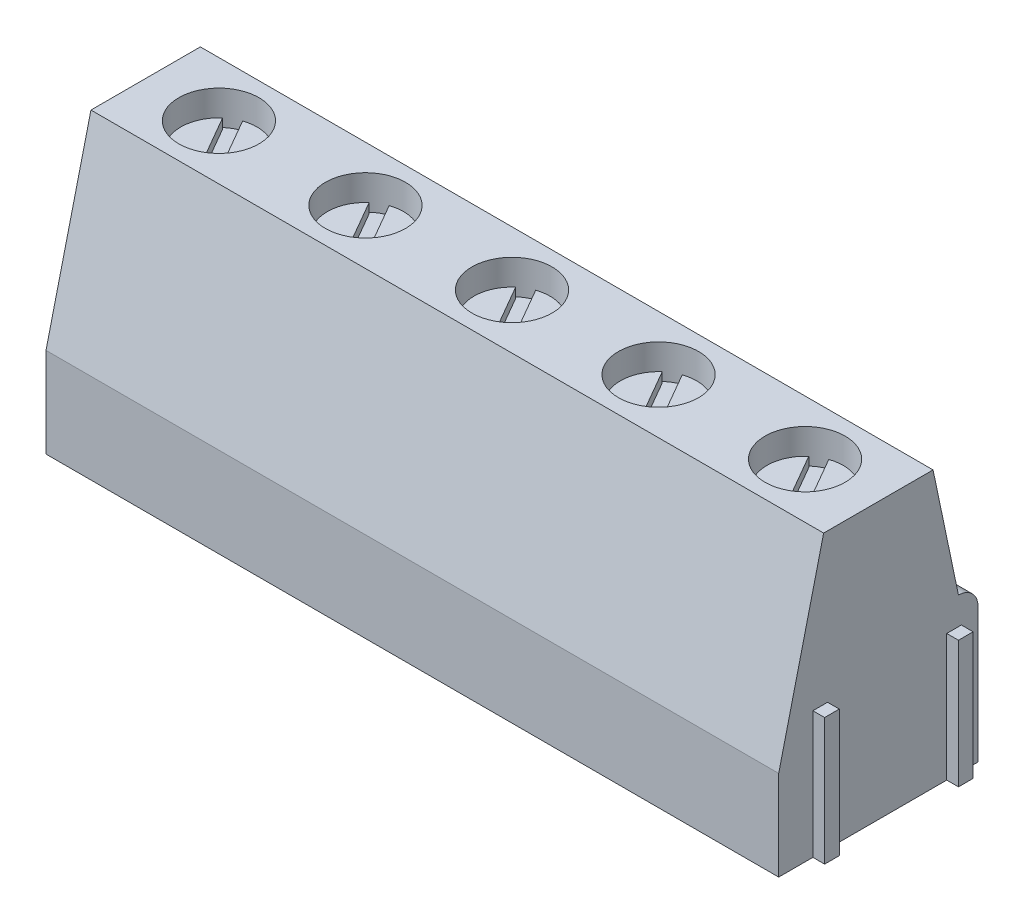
ISO-10303-21;
HEADER;
FILE_DESCRIPTION(('STEP AP214'),'2;1');
FILE_NAME('part.step','',(''),(''),'','','');
FILE_SCHEMA(('AUTOMOTIVE_DESIGN { 1 0 10303 214 1 1 1 1 }'));
ENDSEC;
DATA;
#1=APPLICATION_CONTEXT('core data for automotive mechanical design processes');
#2=APPLICATION_PROTOCOL_DEFINITION('international standard','automotive_design',2000,#1);
#3=PRODUCT_CONTEXT('',#1,'mechanical');
#4=PRODUCT('Part','Part','',(#3));
#5=PRODUCT_RELATED_PRODUCT_CATEGORY('part','',(#4));
#6=PRODUCT_DEFINITION_FORMATION('','',#4);
#7=PRODUCT_DEFINITION_CONTEXT('part definition',#1,'design');
#8=PRODUCT_DEFINITION('design','',#6,#7);
#9=PRODUCT_DEFINITION_SHAPE('','',#8);
#10=(LENGTH_UNIT() NAMED_UNIT(*) SI_UNIT(.MILLI.,.METRE.));
#11=(NAMED_UNIT(*) PLANE_ANGLE_UNIT() SI_UNIT($,.RADIAN.));
#12=(NAMED_UNIT(*) SI_UNIT($,.STERADIAN.) SOLID_ANGLE_UNIT());
#13=UNCERTAINTY_MEASURE_WITH_UNIT(LENGTH_MEASURE(1.E-05),#10,'distance_accuracy_value','');
#14=(GEOMETRIC_REPRESENTATION_CONTEXT(3) GLOBAL_UNCERTAINTY_ASSIGNED_CONTEXT((#13)) GLOBAL_UNIT_ASSIGNED_CONTEXT((#10,
#11,#12)) REPRESENTATION_CONTEXT('',''));
#15=CARTESIAN_POINT('',(0.,0.,0.));
#16=DIRECTION('',(0.,0.,1.));
#17=DIRECTION('',(1.,0.,0.));
#18=AXIS2_PLACEMENT_3D('',#15,#16,#17);
#19=CARTESIAN_POINT('',(15.,12.85,0.));
#20=DIRECTION('',(0.,1.,0.));
#21=DIRECTION('',(0.,0.,1.));
#22=AXIS2_PLACEMENT_3D('',#19,#20,#21);
#23=CYLINDRICAL_SURFACE('',#22,2.05);
#24=CARTESIAN_POINT('',(15.,14.1,0.));
#25=DIRECTION('',(0.,1.,0.));
#26=DIRECTION('',(0.,0.,1.));
#27=AXIS2_PLACEMENT_3D('',#24,#25,#26);
#28=CIRCLE('',#27,2.05);
#29=CARTESIAN_POINT('',(15.,14.1,2.05));
#30=VERTEX_POINT('',#29);
#31=EDGE_CURVE('E11',#30,#30,#28,.T.);
#32=ORIENTED_EDGE('',*,*,#31,.T.);
#33=EDGE_LOOP('',(#32));
#34=FACE_BOUND('',#33,.T.);
#35=CARTESIAN_POINT('',(15.,12.35,0.));
#36=DIRECTION('',(0.,1.,0.));
#37=DIRECTION('',(0.,0.,1.));
#38=AXIS2_PLACEMENT_3D('',#35,#36,#37);
#39=CIRCLE('',#38,2.05);
#40=CARTESIAN_POINT('',(15.,12.35,2.05));
#41=VERTEX_POINT('',#40);
#42=EDGE_CURVE('E753',#41,#41,#39,.T.);
#43=ORIENTED_EDGE('',*,*,#42,.F.);
#44=EDGE_LOOP('',(#43));
#45=FACE_BOUND('',#44,.T.);
#46=ADVANCED_FACE('F17',(#34,#45),#23,.F.);
#47=CARTESIAN_POINT('',(15.,12.35,0.));
#48=DIRECTION('',(0.,1.,0.));
#49=DIRECTION('',(0.,0.,1.));
#50=AXIS2_PLACEMENT_3D('',#47,#48,#49);
#51=CYLINDRICAL_SURFACE('',#50,1.95);
#52=CARTESIAN_POINT('',(15.,12.35,0.));
#53=DIRECTION('',(0.,1.,0.));
#54=DIRECTION('',(0.,0.,1.));
#55=AXIS2_PLACEMENT_3D('',#52,#53,#54);
#56=CIRCLE('',#55,1.95);
#57=CARTESIAN_POINT('',(13.7184391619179,12.35,-1.46972848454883));
#58=VERTEX_POINT('',#57);
#59=CARTESIAN_POINT('',(15.6320417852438,12.35,1.84472848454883));
#60=VERTEX_POINT('',#59);
#61=EDGE_CURVE('E27',#58,#60,#56,.T.);
#62=ORIENTED_EDGE('',*,*,#61,.T.);
#63=DIRECTION('',(0.,1.,0.));
#64=VECTOR('',#63,1.);
#65=CARTESIAN_POINT('',(15.6320417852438,12.35,1.84472848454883));
#66=LINE('',#65,#64);
#67=CARTESIAN_POINT('',(15.6320417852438,12.85,1.84472848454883));
#68=VERTEX_POINT('',#67);
#69=EDGE_CURVE('E759',#60,#68,#66,.T.);
#70=ORIENTED_EDGE('',*,*,#69,.T.);
#71=CARTESIAN_POINT('',(15.,12.85,0.));
#72=DIRECTION('',(0.,1.,0.));
#73=DIRECTION('',(0.,0.,1.));
#74=AXIS2_PLACEMENT_3D('',#71,#72,#73);
#75=CIRCLE('',#74,1.95);
#76=CARTESIAN_POINT('',(13.7184391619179,12.85,-1.46972848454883));
#77=VERTEX_POINT('',#76);
#78=EDGE_CURVE('E36',#77,#68,#75,.T.);
#79=ORIENTED_EDGE('',*,*,#78,.F.);
#80=DIRECTION('',(0.,1.,0.));
#81=VECTOR('',#80,1.);
#82=CARTESIAN_POINT('',(13.7184391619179,12.35,-1.46972848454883));
#83=LINE('',#82,#81);
#84=EDGE_CURVE('E758',#58,#77,#83,.T.);
#85=ORIENTED_EDGE('',*,*,#84,.F.);
#86=EDGE_LOOP('',(#62,#70,#79,#85));
#87=FACE_BOUND('',#86,.T.);
#88=ADVANCED_FACE('F1119',(#87),#51,.T.);
#89=CARTESIAN_POINT('',(7.5,12.85,0.));
#90=DIRECTION('',(0.,1.,0.));
#91=DIRECTION('',(0.,0.,1.));
#92=AXIS2_PLACEMENT_3D('',#89,#90,#91);
#93=CYLINDRICAL_SURFACE('',#92,2.05);
#94=CARTESIAN_POINT('',(7.5,14.1,0.));
#95=DIRECTION('',(0.,1.,0.));
#96=DIRECTION('',(0.,0.,1.));
#97=AXIS2_PLACEMENT_3D('',#94,#95,#96);
#98=CIRCLE('',#97,2.05);
#99=CARTESIAN_POINT('',(7.5,14.1,2.05));
#100=VERTEX_POINT('',#99);
#101=EDGE_CURVE('E1105',#100,#100,#98,.T.);
#102=ORIENTED_EDGE('',*,*,#101,.T.);
#103=EDGE_LOOP('',(#102));
#104=FACE_BOUND('',#103,.T.);
#105=CARTESIAN_POINT('',(7.5,12.35,0.));
#106=DIRECTION('',(0.,1.,0.));
#107=DIRECTION('',(0.,0.,1.));
#108=AXIS2_PLACEMENT_3D('',#105,#106,#107);
#109=CIRCLE('',#108,2.05);
#110=CARTESIAN_POINT('',(7.5,12.35,2.05));
#111=VERTEX_POINT('',#110);
#112=EDGE_CURVE('E780',#111,#111,#109,.T.);
#113=ORIENTED_EDGE('',*,*,#112,.F.);
#114=EDGE_LOOP('',(#113));
#115=FACE_BOUND('',#114,.T.);
#116=ADVANCED_FACE('F1126',(#104,#115),#93,.F.);
#117=CARTESIAN_POINT('',(7.5,12.35,0.));
#118=DIRECTION('',(0.,1.,0.));
#119=DIRECTION('',(0.,0.,1.));
#120=AXIS2_PLACEMENT_3D('',#117,#118,#119);
#121=CYLINDRICAL_SURFACE('',#120,1.95);
#122=CARTESIAN_POINT('',(7.5,12.35,0.));
#123=DIRECTION('',(0.,1.,0.));
#124=DIRECTION('',(0.,0.,1.));
#125=AXIS2_PLACEMENT_3D('',#122,#123,#124);
#126=CIRCLE('',#125,1.95);
#127=CARTESIAN_POINT('',(6.21843916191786,12.35,-1.46972848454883));
#128=VERTEX_POINT('',#127);
#129=CARTESIAN_POINT('',(8.13204178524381,12.35,1.84472848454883));
#130=VERTEX_POINT('',#129);
#131=EDGE_CURVE('E1098',#128,#130,#126,.T.);
#132=ORIENTED_EDGE('',*,*,#131,.T.);
#133=DIRECTION('',(0.,1.,0.));
#134=VECTOR('',#133,1.);
#135=CARTESIAN_POINT('',(8.13204178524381,12.35,1.84472848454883));
#136=LINE('',#135,#134);
#137=CARTESIAN_POINT('',(8.1320417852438,12.85,1.84472848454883));
#138=VERTEX_POINT('',#137);
#139=EDGE_CURVE('E786',#130,#138,#136,.T.);
#140=ORIENTED_EDGE('',*,*,#139,.T.);
#141=CARTESIAN_POINT('',(7.5,12.85,0.));
#142=DIRECTION('',(0.,1.,0.));
#143=DIRECTION('',(0.,0.,1.));
#144=AXIS2_PLACEMENT_3D('',#141,#142,#143);
#145=CIRCLE('',#144,1.95);
#146=CARTESIAN_POINT('',(6.21843916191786,12.85,-1.46972848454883));
#147=VERTEX_POINT('',#146);
#148=EDGE_CURVE('E757',#147,#138,#145,.T.);
#149=ORIENTED_EDGE('',*,*,#148,.F.);
#150=DIRECTION('',(0.,1.,0.));
#151=VECTOR('',#150,1.);
#152=CARTESIAN_POINT('',(6.21843916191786,12.35,-1.46972848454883));
#153=LINE('',#152,#151);
#154=EDGE_CURVE('E785',#128,#147,#153,.T.);
#155=ORIENTED_EDGE('',*,*,#154,.F.);
#156=EDGE_LOOP('',(#132,#140,#149,#155));
#157=FACE_BOUND('',#156,.T.);
#158=ADVANCED_FACE('F1131',(#157),#121,.T.);
#159=CARTESIAN_POINT('',(0.,12.85,0.));
#160=DIRECTION('',(0.,1.,0.));
#161=DIRECTION('',(0.,0.,1.));
#162=AXIS2_PLACEMENT_3D('',#159,#160,#161);
#163=CYLINDRICAL_SURFACE('',#162,2.05);
#164=CARTESIAN_POINT('',(0.,14.1,0.));
#165=DIRECTION('',(0.,1.,0.));
#166=DIRECTION('',(0.,0.,1.));
#167=AXIS2_PLACEMENT_3D('',#164,#165,#166);
#168=CIRCLE('',#167,2.05);
#169=CARTESIAN_POINT('',(0.,14.1,2.05));
#170=VERTEX_POINT('',#169);
#171=EDGE_CURVE('E1095',#170,#170,#168,.T.);
#172=ORIENTED_EDGE('',*,*,#171,.T.);
#173=EDGE_LOOP('',(#172));
#174=FACE_BOUND('',#173,.T.);
#175=CARTESIAN_POINT('',(0.,12.35,0.));
#176=DIRECTION('',(0.,1.,0.));
#177=DIRECTION('',(0.,0.,1.));
#178=AXIS2_PLACEMENT_3D('',#175,#176,#177);
#179=CIRCLE('',#178,2.05);
#180=CARTESIAN_POINT('',(0.,12.35,2.05));
#181=VERTEX_POINT('',#180);
#182=EDGE_CURVE('E808',#181,#181,#179,.T.);
#183=ORIENTED_EDGE('',*,*,#182,.F.);
#184=EDGE_LOOP('',(#183));
#185=FACE_BOUND('',#184,.T.);
#186=ADVANCED_FACE('F1135',(#174,#185),#163,.F.);
#187=CARTESIAN_POINT('',(0.,12.35,0.));
#188=DIRECTION('',(0.,1.,0.));
#189=DIRECTION('',(0.,0.,1.));
#190=AXIS2_PLACEMENT_3D('',#187,#188,#189);
#191=CYLINDRICAL_SURFACE('',#190,1.95);
#192=CARTESIAN_POINT('',(0.,12.35,0.));
#193=DIRECTION('',(0.,1.,0.));
#194=DIRECTION('',(0.,0.,1.));
#195=AXIS2_PLACEMENT_3D('',#192,#193,#194);
#196=CIRCLE('',#195,1.95);
#197=CARTESIAN_POINT('',(-1.28156083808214,12.35,-1.46972848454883));
#198=VERTEX_POINT('',#197);
#199=CARTESIAN_POINT('',(0.632041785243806,12.35,1.84472848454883));
#200=VERTEX_POINT('',#199);
#201=EDGE_CURVE('E1090',#198,#200,#196,.T.);
#202=ORIENTED_EDGE('',*,*,#201,.T.);
#203=DIRECTION('',(0.,1.,0.));
#204=VECTOR('',#203,1.);
#205=CARTESIAN_POINT('',(0.632041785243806,12.35,1.84472848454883));
#206=LINE('',#205,#204);
#207=CARTESIAN_POINT('',(0.632041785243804,12.85,1.84472848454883));
#208=VERTEX_POINT('',#207);
#209=EDGE_CURVE('E814',#200,#208,#206,.T.);
#210=ORIENTED_EDGE('',*,*,#209,.T.);
#211=CARTESIAN_POINT('',(0.,12.85,0.));
#212=DIRECTION('',(0.,1.,0.));
#213=DIRECTION('',(0.,0.,1.));
#214=AXIS2_PLACEMENT_3D('',#211,#212,#213);
#215=CIRCLE('',#214,1.95);
#216=CARTESIAN_POINT('',(-1.28156083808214,12.85,-1.46972848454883));
#217=VERTEX_POINT('',#216);
#218=EDGE_CURVE('E784',#217,#208,#215,.T.);
#219=ORIENTED_EDGE('',*,*,#218,.F.);
#220=DIRECTION('',(0.,1.,0.));
#221=VECTOR('',#220,1.);
#222=CARTESIAN_POINT('',(-1.28156083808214,12.35,-1.46972848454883));
#223=LINE('',#222,#221);
#224=EDGE_CURVE('E813',#198,#217,#223,.T.);
#225=ORIENTED_EDGE('',*,*,#224,.F.);
#226=EDGE_LOOP('',(#202,#210,#219,#225));
#227=FACE_BOUND('',#226,.T.);
#228=ADVANCED_FACE('F1139',(#227),#191,.T.);
#229=CARTESIAN_POINT('',(-7.5,12.35,0.));
#230=DIRECTION('',(0.,1.,0.));
#231=DIRECTION('',(0.,0.,1.));
#232=AXIS2_PLACEMENT_3D('',#229,#230,#231);
#233=CYLINDRICAL_SURFACE('',#232,1.95);
#234=CARTESIAN_POINT('',(-7.5,12.35,0.));
#235=DIRECTION('',(0.,1.,0.));
#236=DIRECTION('',(0.,0.,1.));
#237=AXIS2_PLACEMENT_3D('',#234,#235,#236);
#238=CIRCLE('',#237,1.95);
#239=CARTESIAN_POINT('',(-8.78156083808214,12.35,-1.46972848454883));
#240=VERTEX_POINT('',#239);
#241=CARTESIAN_POINT('',(-6.86795821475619,12.35,1.84472848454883));
#242=VERTEX_POINT('',#241);
#243=EDGE_CURVE('E1084',#240,#242,#238,.T.);
#244=ORIENTED_EDGE('',*,*,#243,.T.);
#245=DIRECTION('',(0.,1.,0.));
#246=VECTOR('',#245,1.);
#247=CARTESIAN_POINT('',(-6.86795821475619,12.35,1.84472848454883));
#248=LINE('',#247,#246);
#249=CARTESIAN_POINT('',(-6.8679582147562,12.85,1.84472848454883));
#250=VERTEX_POINT('',#249);
#251=EDGE_CURVE('E819',#242,#250,#248,.T.);
#252=ORIENTED_EDGE('',*,*,#251,.T.);
#253=CARTESIAN_POINT('',(-7.5,12.85,0.));
#254=DIRECTION('',(0.,1.,0.));
#255=DIRECTION('',(0.,0.,1.));
#256=AXIS2_PLACEMENT_3D('',#253,#254,#255);
#257=CIRCLE('',#256,1.95);
#258=CARTESIAN_POINT('',(-8.78156083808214,12.85,-1.46972848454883));
#259=VERTEX_POINT('',#258);
#260=EDGE_CURVE('E843',#259,#250,#257,.T.);
#261=ORIENTED_EDGE('',*,*,#260,.F.);
#262=DIRECTION('',(0.,1.,0.));
#263=VECTOR('',#262,1.);
#264=CARTESIAN_POINT('',(-8.78156083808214,12.35,-1.46972848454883));
#265=LINE('',#264,#263);
#266=EDGE_CURVE('E812',#240,#259,#265,.T.);
#267=ORIENTED_EDGE('',*,*,#266,.F.);
#268=EDGE_LOOP('',(#244,#252,#261,#267));
#269=FACE_BOUND('',#268,.T.);
#270=ADVANCED_FACE('F1143',(#269),#233,.T.);
#271=CARTESIAN_POINT('',(-7.5,12.85,0.));
#272=DIRECTION('',(0.,1.,0.));
#273=DIRECTION('',(0.,0.,1.));
#274=AXIS2_PLACEMENT_3D('',#271,#272,#273);
#275=CYLINDRICAL_SURFACE('',#274,2.05);
#276=CARTESIAN_POINT('',(-7.5,14.1,0.));
#277=DIRECTION('',(0.,1.,0.));
#278=DIRECTION('',(0.,0.,1.));
#279=AXIS2_PLACEMENT_3D('',#276,#277,#278);
#280=CIRCLE('',#279,2.05);
#281=CARTESIAN_POINT('',(-7.5,14.1,2.05));
#282=VERTEX_POINT('',#281);
#283=EDGE_CURVE('E1081',#282,#282,#280,.T.);
#284=ORIENTED_EDGE('',*,*,#283,.T.);
#285=EDGE_LOOP('',(#284));
#286=FACE_BOUND('',#285,.T.);
#287=CARTESIAN_POINT('',(-7.5,12.35,0.));
#288=DIRECTION('',(0.,1.,0.));
#289=DIRECTION('',(0.,0.,1.));
#290=AXIS2_PLACEMENT_3D('',#287,#288,#289);
#291=CIRCLE('',#290,2.05);
#292=CARTESIAN_POINT('',(-7.5,12.35,2.05));
#293=VERTEX_POINT('',#292);
#294=EDGE_CURVE('E822',#293,#293,#291,.T.);
#295=ORIENTED_EDGE('',*,*,#294,.F.);
#296=EDGE_LOOP('',(#295));
#297=FACE_BOUND('',#296,.T.);
#298=ADVANCED_FACE('F1147',(#286,#297),#275,.F.);
#299=CARTESIAN_POINT('',(-15.,12.35,0.));
#300=DIRECTION('',(0.,1.,0.));
#301=DIRECTION('',(0.,0.,1.));
#302=AXIS2_PLACEMENT_3D('',#299,#300,#301);
#303=CYLINDRICAL_SURFACE('',#302,1.95);
#304=CARTESIAN_POINT('',(-15.,12.35,0.));
#305=DIRECTION('',(0.,1.,0.));
#306=DIRECTION('',(0.,0.,1.));
#307=AXIS2_PLACEMENT_3D('',#304,#305,#306);
#308=CIRCLE('',#307,1.95);
#309=CARTESIAN_POINT('',(-16.2815608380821,12.35,-1.46972848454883));
#310=VERTEX_POINT('',#309);
#311=CARTESIAN_POINT('',(-14.3679582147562,12.35,1.84472848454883));
#312=VERTEX_POINT('',#311);
#313=EDGE_CURVE('E1074',#310,#312,#308,.T.);
#314=ORIENTED_EDGE('',*,*,#313,.T.);
#315=DIRECTION('',(0.,1.,0.));
#316=VECTOR('',#315,1.);
#317=CARTESIAN_POINT('',(-14.3679582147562,12.35,1.84472848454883));
#318=LINE('',#317,#316);
#319=CARTESIAN_POINT('',(-14.3679582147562,12.85,1.84472848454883));
#320=VERTEX_POINT('',#319);
#321=EDGE_CURVE('E900',#312,#320,#318,.T.);
#322=ORIENTED_EDGE('',*,*,#321,.T.);
#323=CARTESIAN_POINT('',(-15.,12.85,0.));
#324=DIRECTION('',(0.,1.,0.));
#325=DIRECTION('',(0.,0.,1.));
#326=AXIS2_PLACEMENT_3D('',#323,#324,#325);
#327=CIRCLE('',#326,1.95);
#328=CARTESIAN_POINT('',(-16.2815608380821,12.85,-1.46972848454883));
#329=VERTEX_POINT('',#328);
#330=EDGE_CURVE('E899',#329,#320,#327,.T.);
#331=ORIENTED_EDGE('',*,*,#330,.F.);
#332=DIRECTION('',(0.,1.,0.));
#333=VECTOR('',#332,1.);
#334=CARTESIAN_POINT('',(-16.2815608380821,12.35,-1.46972848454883));
#335=LINE('',#334,#333);
#336=EDGE_CURVE('E908',#310,#329,#335,.T.);
#337=ORIENTED_EDGE('',*,*,#336,.F.);
#338=EDGE_LOOP('',(#314,#322,#331,#337));
#339=FACE_BOUND('',#338,.T.);
#340=ADVANCED_FACE('F1151',(#339),#303,.T.);
#341=CARTESIAN_POINT('',(-15.,12.85,0.));
#342=DIRECTION('',(0.,1.,0.));
#343=DIRECTION('',(0.,0.,1.));
#344=AXIS2_PLACEMENT_3D('',#341,#342,#343);
#345=CYLINDRICAL_SURFACE('',#344,2.05);
#346=CARTESIAN_POINT('',(-15.,14.1,0.));
#347=DIRECTION('',(0.,1.,0.));
#348=DIRECTION('',(0.,0.,1.));
#349=AXIS2_PLACEMENT_3D('',#346,#347,#348);
#350=CIRCLE('',#349,2.05);
#351=CARTESIAN_POINT('',(-15.,14.1,2.05));
#352=VERTEX_POINT('',#351);
#353=EDGE_CURVE('E1069',#352,#352,#350,.T.);
#354=ORIENTED_EDGE('',*,*,#353,.T.);
#355=EDGE_LOOP('',(#354));
#356=FACE_BOUND('',#355,.T.);
#357=CARTESIAN_POINT('',(-15.,12.35,0.));
#358=DIRECTION('',(0.,1.,0.));
#359=DIRECTION('',(0.,0.,1.));
#360=AXIS2_PLACEMENT_3D('',#357,#358,#359);
#361=CIRCLE('',#360,2.05);
#362=CARTESIAN_POINT('',(-15.,12.35,2.05));
#363=VERTEX_POINT('',#362);
#364=EDGE_CURVE('E919',#363,#363,#361,.T.);
#365=ORIENTED_EDGE('',*,*,#364,.F.);
#366=EDGE_LOOP('',(#365));
#367=FACE_BOUND('',#366,.T.);
#368=ADVANCED_FACE('F1155',(#356,#367),#345,.F.);
#369=CARTESIAN_POINT('',(18.75,14.1,5.1));
#370=DIRECTION('',(-1.,0.,0.));
#371=DIRECTION('',(0.,0.,1.));
#372=AXIS2_PLACEMENT_3D('',#369,#370,#371);
#373=PLANE('',#372);
#374=DIRECTION('',(0.,1.,0.));
#375=VECTOR('',#374,1.);
#376=CARTESIAN_POINT('',(18.75,0.,2.6));
#377=LINE('',#376,#375);
#378=CARTESIAN_POINT('',(18.75,0.,2.6));
#379=VERTEX_POINT('',#378);
#380=CARTESIAN_POINT('',(18.75,6.5,2.6));
#381=VERTEX_POINT('',#380);
#382=EDGE_CURVE('E535',#379,#381,#377,.T.);
#383=ORIENTED_EDGE('',*,*,#382,.F.);
#384=DIRECTION('',(0.,0.,-1.));
#385=VECTOR('',#384,1.);
#386=CARTESIAN_POINT('',(18.75,0.,5.1));
#387=LINE('',#386,#385);
#388=CARTESIAN_POINT('',(18.75,0.,-3.5));
#389=VERTEX_POINT('',#388);
#390=EDGE_CURVE('E1062',#379,#389,#387,.T.);
#391=ORIENTED_EDGE('',*,*,#390,.T.);
#392=DIRECTION('',(0.,-1.,0.));
#393=VECTOR('',#392,1.);
#394=CARTESIAN_POINT('',(18.75,6.5,-3.5));
#395=LINE('',#394,#393);
#396=CARTESIAN_POINT('',(18.75,6.5,-3.5));
#397=VERTEX_POINT('',#396);
#398=EDGE_CURVE('E546',#397,#389,#395,.T.);
#399=ORIENTED_EDGE('',*,*,#398,.F.);
#400=DIRECTION('',(0.,0.,1.));
#401=VECTOR('',#400,1.);
#402=CARTESIAN_POINT('',(18.75,6.5,-4.25));
#403=LINE('',#402,#401);
#404=CARTESIAN_POINT('',(18.75,6.5,-4.25));
#405=VERTEX_POINT('',#404);
#406=EDGE_CURVE('E541',#405,#397,#403,.T.);
#407=ORIENTED_EDGE('',*,*,#406,.F.);
#408=DIRECTION('',(0.,1.,0.));
#409=VECTOR('',#408,1.);
#410=CARTESIAN_POINT('',(18.75,0.,-4.25));
#411=LINE('',#410,#409);
#412=CARTESIAN_POINT('',(18.75,0.,-4.25));
#413=VERTEX_POINT('',#412);
#414=EDGE_CURVE('E547',#413,#405,#411,.T.);
#415=ORIENTED_EDGE('',*,*,#414,.F.);
#416=DIRECTION('',(0.,0.,-1.));
#417=VECTOR('',#416,1.);
#418=CARTESIAN_POINT('',(18.75,0.,5.1));
#419=LINE('',#418,#417);
#420=CARTESIAN_POINT('',(18.75,0.,-5.1));
#421=VERTEX_POINT('',#420);
#422=EDGE_CURVE('E1058',#413,#421,#419,.T.);
#423=ORIENTED_EDGE('',*,*,#422,.T.);
#424=DIRECTION('',(0.,-1.,0.));
#425=VECTOR('',#424,1.);
#426=CARTESIAN_POINT('',(18.75,14.1,-5.1));
#427=LINE('',#426,#425);
#428=CARTESIAN_POINT('',(18.75,6.9,-5.1));
#429=VERTEX_POINT('',#428);
#430=EDGE_CURVE('E964',#429,#421,#427,.T.);
#431=ORIENTED_EDGE('',*,*,#430,.F.);
#432=CARTESIAN_POINT('',(18.75,6.9,-4.1));
#433=DIRECTION('',(1.,0.,0.));
#434=DIRECTION('',(0.,0.,1.));
#435=AXIS2_PLACEMENT_3D('',#432,#433,#434);
#436=CIRCLE('',#435,1.);
#437=CARTESIAN_POINT('',(18.75,7.9,-4.1));
#438=VERTEX_POINT('',#437);
#439=EDGE_CURVE('E1051',#429,#438,#436,.T.);
#440=ORIENTED_EDGE('',*,*,#439,.T.);
#441=DIRECTION('',(0.,-0.978716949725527,-0.205214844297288));
#442=VECTOR('',#441,1.);
#443=CARTESIAN_POINT('',(18.75,7.9,-4.1));
#444=LINE('',#443,#442);
#445=CARTESIAN_POINT('',(18.75,14.1,-2.8));
#446=VERTEX_POINT('',#445);
#447=EDGE_CURVE('E960',#446,#438,#444,.T.);
#448=ORIENTED_EDGE('',*,*,#447,.F.);
#449=DIRECTION('',(0.,0.,-1.));
#450=VECTOR('',#449,1.);
#451=CARTESIAN_POINT('',(18.75,14.1,5.1));
#452=LINE('',#451,#450);
#453=CARTESIAN_POINT('',(18.75,14.1,2.8));
#454=VERTEX_POINT('',#453);
#455=EDGE_CURVE('E965',#454,#446,#452,.T.);
#456=ORIENTED_EDGE('',*,*,#455,.F.);
#457=DIRECTION('',(0.,0.971921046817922,-0.23530720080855));
#458=VECTOR('',#457,1.);
#459=CARTESIAN_POINT('',(18.75,4.6,5.1));
#460=LINE('',#459,#458);
#461=CARTESIAN_POINT('',(18.75,4.6,5.1));
#462=VERTEX_POINT('',#461);
#463=EDGE_CURVE('E931',#462,#454,#460,.T.);
#464=ORIENTED_EDGE('',*,*,#463,.F.);
#465=DIRECTION('',(0.,-1.,0.));
#466=VECTOR('',#465,1.);
#467=CARTESIAN_POINT('',(18.75,14.1,5.1));
#468=LINE('',#467,#466);
#469=CARTESIAN_POINT('',(18.75,0.,5.1));
#470=VERTEX_POINT('',#469);
#471=EDGE_CURVE('E1048',#462,#470,#468,.T.);
#472=ORIENTED_EDGE('',*,*,#471,.T.);
#473=DIRECTION('',(0.,0.,-1.));
#474=VECTOR('',#473,1.);
#475=CARTESIAN_POINT('',(18.75,0.,5.1));
#476=LINE('',#475,#474);
#477=CARTESIAN_POINT('',(18.75,0.,3.35));
#478=VERTEX_POINT('',#477);
#479=EDGE_CURVE('E1039',#470,#478,#476,.T.);
#480=ORIENTED_EDGE('',*,*,#479,.T.);
#481=DIRECTION('',(0.,-1.,0.));
#482=VECTOR('',#481,1.);
#483=CARTESIAN_POINT('',(18.75,6.5,3.35));
#484=LINE('',#483,#482);
#485=CARTESIAN_POINT('',(18.75,6.5,3.35));
#486=VERTEX_POINT('',#485);
#487=EDGE_CURVE('E524',#486,#478,#484,.T.);
#488=ORIENTED_EDGE('',*,*,#487,.F.);
#489=DIRECTION('',(0.,0.,1.));
#490=VECTOR('',#489,1.);
#491=CARTESIAN_POINT('',(18.75,6.5,2.6));
#492=LINE('',#491,#490);
#493=EDGE_CURVE('E530',#381,#486,#492,.T.);
#494=ORIENTED_EDGE('',*,*,#493,.F.);
#495=EDGE_LOOP('',(#383,#391,#399,#407,#415,#423,#431,#440,#448,#456,#464,#472,#480,#488,#494));
#496=FACE_BOUND('',#495,.T.);
#497=ADVANCED_FACE('F1159',(#496),#373,.F.);
#498=CARTESIAN_POINT('',(-18.75,14.1,5.1));
#499=DIRECTION('',(1.,0.,0.));
#500=DIRECTION('',(0.,0.,-1.));
#501=AXIS2_PLACEMENT_3D('',#498,#499,#500);
#502=PLANE('',#501);
#503=DIRECTION('',(0.,0.,-1.));
#504=VECTOR('',#503,1.);
#505=CARTESIAN_POINT('',(-18.75,6.5,3.35));
#506=LINE('',#505,#504);
#507=CARTESIAN_POINT('',(-18.75,6.5,3.35));
#508=VERTEX_POINT('',#507);
#509=CARTESIAN_POINT('',(-18.75,6.5,2.6));
#510=VERTEX_POINT('',#509);
#511=EDGE_CURVE('E488',#508,#510,#506,.T.);
#512=ORIENTED_EDGE('',*,*,#511,.F.);
#513=DIRECTION('',(0.,1.,0.));
#514=VECTOR('',#513,1.);
#515=CARTESIAN_POINT('',(-18.75,0.,3.35));
#516=LINE('',#515,#514);
#517=CARTESIAN_POINT('',(-18.75,0.,3.35));
#518=VERTEX_POINT('',#517);
#519=EDGE_CURVE('E514',#518,#508,#516,.T.);
#520=ORIENTED_EDGE('',*,*,#519,.F.);
#521=DIRECTION('',(0.,0.,1.));
#522=VECTOR('',#521,1.);
#523=CARTESIAN_POINT('',(-18.75,0.,5.1));
#524=LINE('',#523,#522);
#525=CARTESIAN_POINT('',(-18.75,0.,5.1));
#526=VERTEX_POINT('',#525);
#527=EDGE_CURVE('E1035',#518,#526,#524,.T.);
#528=ORIENTED_EDGE('',*,*,#527,.T.);
#529=DIRECTION('',(0.,-1.,0.));
#530=VECTOR('',#529,1.);
#531=CARTESIAN_POINT('',(-18.75,14.1,5.1));
#532=LINE('',#531,#530);
#533=CARTESIAN_POINT('',(-18.75,4.6,5.1));
#534=VERTEX_POINT('',#533);
#535=EDGE_CURVE('E1008',#534,#526,#532,.T.);
#536=ORIENTED_EDGE('',*,*,#535,.F.);
#537=DIRECTION('',(0.,0.971921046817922,-0.23530720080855));
#538=VECTOR('',#537,1.);
#539=CARTESIAN_POINT('',(-18.75,4.6,5.1));
#540=LINE('',#539,#538);
#541=CARTESIAN_POINT('',(-18.75,14.1,2.8));
#542=VERTEX_POINT('',#541);
#543=EDGE_CURVE('E1031',#534,#542,#540,.T.);
#544=ORIENTED_EDGE('',*,*,#543,.T.);
#545=DIRECTION('',(0.,0.,1.));
#546=VECTOR('',#545,1.);
#547=CARTESIAN_POINT('',(-18.75,14.1,5.1));
#548=LINE('',#547,#546);
#549=CARTESIAN_POINT('',(-18.75,14.1,-2.8));
#550=VERTEX_POINT('',#549);
#551=EDGE_CURVE('E957',#550,#542,#548,.T.);
#552=ORIENTED_EDGE('',*,*,#551,.F.);
#553=DIRECTION('',(0.,-0.978716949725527,-0.205214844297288));
#554=VECTOR('',#553,1.);
#555=CARTESIAN_POINT('',(-18.75,7.9,-4.1));
#556=LINE('',#555,#554);
#557=CARTESIAN_POINT('',(-18.75,7.9,-4.1));
#558=VERTEX_POINT('',#557);
#559=EDGE_CURVE('E1028',#550,#558,#556,.T.);
#560=ORIENTED_EDGE('',*,*,#559,.T.);
#561=CARTESIAN_POINT('',(-18.75,6.9,-4.1));
#562=DIRECTION('',(-1.,0.,0.));
#563=DIRECTION('',(0.,0.,-1.));
#564=AXIS2_PLACEMENT_3D('',#561,#562,#563);
#565=CIRCLE('',#564,1.);
#566=CARTESIAN_POINT('',(-18.75,6.9,-5.1));
#567=VERTEX_POINT('',#566);
#568=EDGE_CURVE('E1025',#558,#567,#565,.T.);
#569=ORIENTED_EDGE('',*,*,#568,.T.);
#570=DIRECTION('',(0.,-1.,0.));
#571=VECTOR('',#570,1.);
#572=CARTESIAN_POINT('',(-18.75,14.1,-5.1));
#573=LINE('',#572,#571);
#574=CARTESIAN_POINT('',(-18.75,0.,-5.1));
#575=VERTEX_POINT('',#574);
#576=EDGE_CURVE('E1022',#567,#575,#573,.T.);
#577=ORIENTED_EDGE('',*,*,#576,.T.);
#578=DIRECTION('',(0.,0.,1.));
#579=VECTOR('',#578,1.);
#580=CARTESIAN_POINT('',(-18.75,0.,5.1));
#581=LINE('',#580,#579);
#582=CARTESIAN_POINT('',(-18.75,0.,-4.25));
#583=VERTEX_POINT('',#582);
#584=EDGE_CURVE('E1016',#575,#583,#581,.T.);
#585=ORIENTED_EDGE('',*,*,#584,.T.);
#586=DIRECTION('',(0.,-1.,0.));
#587=VECTOR('',#586,1.);
#588=CARTESIAN_POINT('',(-18.75,6.5,-4.25));
#589=LINE('',#588,#587);
#590=CARTESIAN_POINT('',(-18.75,6.5,-4.25));
#591=VERTEX_POINT('',#590);
#592=EDGE_CURVE('E511',#591,#583,#589,.T.);
#593=ORIENTED_EDGE('',*,*,#592,.F.);
#594=DIRECTION('',(0.,0.,-1.));
#595=VECTOR('',#594,1.);
#596=CARTESIAN_POINT('',(-18.75,6.5,-3.5));
#597=LINE('',#596,#595);
#598=CARTESIAN_POINT('',(-18.75,6.5,-3.5));
#599=VERTEX_POINT('',#598);
#600=EDGE_CURVE('E503',#599,#591,#597,.T.);
#601=ORIENTED_EDGE('',*,*,#600,.F.);
#602=DIRECTION('',(0.,1.,0.));
#603=VECTOR('',#602,1.);
#604=CARTESIAN_POINT('',(-18.75,0.,-3.5));
#605=LINE('',#604,#603);
#606=CARTESIAN_POINT('',(-18.75,0.,-3.5));
#607=VERTEX_POINT('',#606);
#608=EDGE_CURVE('E504',#607,#599,#605,.T.);
#609=ORIENTED_EDGE('',*,*,#608,.F.);
#610=DIRECTION('',(0.,0.,1.));
#611=VECTOR('',#610,1.);
#612=CARTESIAN_POINT('',(-18.75,0.,5.1));
#613=LINE('',#612,#611);
#614=CARTESIAN_POINT('',(-18.75,0.,2.6));
#615=VERTEX_POINT('',#614);
#616=EDGE_CURVE('E1013',#607,#615,#613,.T.);
#617=ORIENTED_EDGE('',*,*,#616,.T.);
#618=DIRECTION('',(0.,-1.,0.));
#619=VECTOR('',#618,1.);
#620=CARTESIAN_POINT('',(-18.75,6.5,2.6));
#621=LINE('',#620,#619);
#622=EDGE_CURVE('E490',#510,#615,#621,.T.);
#623=ORIENTED_EDGE('',*,*,#622,.F.);
#624=EDGE_LOOP('',(#512,#520,#528,#536,#544,#552,#560,#569,#577,#585,#593,#601,#609,#617,#623));
#625=FACE_BOUND('',#624,.T.);
#626=ADVANCED_FACE('F1163',(#625),#502,.F.);
#627=CARTESIAN_POINT('',(-18.75,14.1,5.1));
#628=DIRECTION('',(0.,0.,-1.));
#629=DIRECTION('',(-1.,0.,0.));
#630=AXIS2_PLACEMENT_3D('',#627,#628,#629);
#631=PLANE('',#630);
#632=ORIENTED_EDGE('',*,*,#471,.F.);
#633=DIRECTION('',(1.,0.,0.));
#634=VECTOR('',#633,1.);
#635=CARTESIAN_POINT('',(-18.75,4.6,5.1));
#636=LINE('',#635,#634);
#637=EDGE_CURVE('E1009',#534,#462,#636,.T.);
#638=ORIENTED_EDGE('',*,*,#637,.F.);
#639=ORIENTED_EDGE('',*,*,#535,.T.);
#640=DIRECTION('',(1.,0.,0.));
#641=VECTOR('',#640,1.);
#642=CARTESIAN_POINT('',(-18.75,0.,5.1));
#643=LINE('',#642,#641);
#644=EDGE_CURVE('E969',#526,#470,#643,.T.);
#645=ORIENTED_EDGE('',*,*,#644,.T.);
#646=EDGE_LOOP('',(#632,#638,#639,#645));
#647=FACE_BOUND('',#646,.T.);
#648=ADVANCED_FACE('F1167',(#647),#631,.F.);
#649=CARTESIAN_POINT('',(-18.75,14.1,-5.1));
#650=DIRECTION('',(0.,0.,1.));
#651=DIRECTION('',(1.,0.,0.));
#652=AXIS2_PLACEMENT_3D('',#649,#650,#651);
#653=PLANE('',#652);
#654=DIRECTION('',(1.,0.,0.));
#655=VECTOR('',#654,1.);
#656=CARTESIAN_POINT('',(13.3,6.50000000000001,-5.1));
#657=LINE('',#656,#655);
#658=CARTESIAN_POINT('',(13.3,6.50000000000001,-5.1));
#659=VERTEX_POINT('',#658);
#660=CARTESIAN_POINT('',(16.7,6.50000000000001,-5.1));
#661=VERTEX_POINT('',#660);
#662=EDGE_CURVE('E674',#659,#661,#657,.T.);
#663=ORIENTED_EDGE('',*,*,#662,.F.);
#664=DIRECTION('',(0.,1.,0.));
#665=VECTOR('',#664,1.);
#666=CARTESIAN_POINT('',(13.3,6.50000000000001,-5.1));
#667=LINE('',#666,#665);
#668=CARTESIAN_POINT('',(13.3,1.6,-5.1));
#669=VERTEX_POINT('',#668);
#670=EDGE_CURVE('E994',#669,#659,#667,.T.);
#671=ORIENTED_EDGE('',*,*,#670,.F.);
#672=DIRECTION('',(-1.,0.,0.));
#673=VECTOR('',#672,1.);
#674=CARTESIAN_POINT('',(13.3,1.6,-5.1));
#675=LINE('',#674,#673);
#676=CARTESIAN_POINT('',(16.7,1.6,-5.1));
#677=VERTEX_POINT('',#676);
#678=EDGE_CURVE('E687',#677,#669,#675,.T.);
#679=ORIENTED_EDGE('',*,*,#678,.F.);
#680=DIRECTION('',(0.,-1.,0.));
#681=VECTOR('',#680,1.);
#682=CARTESIAN_POINT('',(16.7,1.6,-5.1));
#683=LINE('',#682,#681);
#684=EDGE_CURVE('E669',#661,#677,#683,.T.);
#685=ORIENTED_EDGE('',*,*,#684,.F.);
#686=EDGE_LOOP('',(#663,#671,#679,#685));
#687=FACE_BOUND('',#686,.T.);
#688=DIRECTION('',(1.,0.,0.));
#689=VECTOR('',#688,1.);
#690=CARTESIAN_POINT('',(5.8,6.50000000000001,-5.1));
#691=LINE('',#690,#689);
#692=CARTESIAN_POINT('',(5.8,6.50000000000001,-5.1));
#693=VERTEX_POINT('',#692);
#694=CARTESIAN_POINT('',(9.2,6.50000000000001,-5.1));
#695=VERTEX_POINT('',#694);
#696=EDGE_CURVE('E691',#693,#695,#691,.T.);
#697=ORIENTED_EDGE('',*,*,#696,.F.);
#698=DIRECTION('',(0.,1.,0.));
#699=VECTOR('',#698,1.);
#700=CARTESIAN_POINT('',(5.8,6.50000000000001,-5.1));
#701=LINE('',#700,#699);
#702=CARTESIAN_POINT('',(5.8,1.6,-5.1));
#703=VERTEX_POINT('',#702);
#704=EDGE_CURVE('E986',#703,#693,#701,.T.);
#705=ORIENTED_EDGE('',*,*,#704,.F.);
#706=DIRECTION('',(-1.,0.,0.));
#707=VECTOR('',#706,1.);
#708=CARTESIAN_POINT('',(5.8,1.6,-5.1));
#709=LINE('',#708,#707);
#710=CARTESIAN_POINT('',(9.2,1.6,-5.1));
#711=VERTEX_POINT('',#710);
#712=EDGE_CURVE('E703',#711,#703,#709,.T.);
#713=ORIENTED_EDGE('',*,*,#712,.F.);
#714=DIRECTION('',(0.,-1.,0.));
#715=VECTOR('',#714,1.);
#716=CARTESIAN_POINT('',(9.2,1.6,-5.1));
#717=LINE('',#716,#715);
#718=EDGE_CURVE('E992',#695,#711,#717,.T.);
#719=ORIENTED_EDGE('',*,*,#718,.F.);
#720=EDGE_LOOP('',(#697,#705,#713,#719));
#721=FACE_BOUND('',#720,.T.);
#722=DIRECTION('',(1.,0.,0.));
#723=VECTOR('',#722,1.);
#724=CARTESIAN_POINT('',(-1.7,6.50000000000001,-5.1));
#725=LINE('',#724,#723);
#726=CARTESIAN_POINT('',(-1.7,6.50000000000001,-5.1));
#727=VERTEX_POINT('',#726);
#728=CARTESIAN_POINT('',(1.7,6.50000000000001,-5.1));
#729=VERTEX_POINT('',#728);
#730=EDGE_CURVE('E707',#727,#729,#725,.T.);
#731=ORIENTED_EDGE('',*,*,#730,.F.);
#732=DIRECTION('',(0.,1.,0.));
#733=VECTOR('',#732,1.);
#734=CARTESIAN_POINT('',(-1.7,6.50000000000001,-5.1));
#735=LINE('',#734,#733);
#736=CARTESIAN_POINT('',(-1.7,1.6,-5.1));
#737=VERTEX_POINT('',#736);
#738=EDGE_CURVE('E978',#737,#727,#735,.T.);
#739=ORIENTED_EDGE('',*,*,#738,.F.);
#740=DIRECTION('',(-1.,0.,0.));
#741=VECTOR('',#740,1.);
#742=CARTESIAN_POINT('',(-1.7,1.6,-5.1));
#743=LINE('',#742,#741);
#744=CARTESIAN_POINT('',(1.7,1.6,-5.1));
#745=VERTEX_POINT('',#744);
#746=EDGE_CURVE('E719',#745,#737,#743,.T.);
#747=ORIENTED_EDGE('',*,*,#746,.F.);
#748=DIRECTION('',(0.,-1.,0.));
#749=VECTOR('',#748,1.);
#750=CARTESIAN_POINT('',(1.7,1.6,-5.1));
#751=LINE('',#750,#749);
#752=EDGE_CURVE('E984',#729,#745,#751,.T.);
#753=ORIENTED_EDGE('',*,*,#752,.F.);
#754=EDGE_LOOP('',(#731,#739,#747,#753));
#755=FACE_BOUND('',#754,.T.);
#756=DIRECTION('',(1.,0.,0.));
#757=VECTOR('',#756,1.);
#758=CARTESIAN_POINT('',(-9.2,6.50000000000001,-5.1));
#759=LINE('',#758,#757);
#760=CARTESIAN_POINT('',(-9.2,6.50000000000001,-5.1));
#761=VERTEX_POINT('',#760);
#762=CARTESIAN_POINT('',(-5.8,6.50000000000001,-5.1));
#763=VERTEX_POINT('',#762);
#764=EDGE_CURVE('E723',#761,#763,#759,.T.);
#765=ORIENTED_EDGE('',*,*,#764,.F.);
#766=DIRECTION('',(0.,1.,0.));
#767=VECTOR('',#766,1.);
#768=CARTESIAN_POINT('',(-9.2,6.50000000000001,-5.1));
#769=LINE('',#768,#767);
#770=CARTESIAN_POINT('',(-9.2,1.6,-5.1));
#771=VERTEX_POINT('',#770);
#772=EDGE_CURVE('E675',#771,#761,#769,.T.);
#773=ORIENTED_EDGE('',*,*,#772,.F.);
#774=DIRECTION('',(-1.,0.,0.));
#775=VECTOR('',#774,1.);
#776=CARTESIAN_POINT('',(-9.2,1.6,-5.1));
#777=LINE('',#776,#775);
#778=CARTESIAN_POINT('',(-5.8,1.6,-5.1));
#779=VERTEX_POINT('',#778);
#780=EDGE_CURVE('E735',#779,#771,#777,.T.);
#781=ORIENTED_EDGE('',*,*,#780,.F.);
#782=DIRECTION('',(0.,-1.,0.));
#783=VECTOR('',#782,1.);
#784=CARTESIAN_POINT('',(-5.8,1.6,-5.1));
#785=LINE('',#784,#783);
#786=EDGE_CURVE('E976',#763,#779,#785,.T.);
#787=ORIENTED_EDGE('',*,*,#786,.F.);
#788=EDGE_LOOP('',(#765,#773,#781,#787));
#789=FACE_BOUND('',#788,.T.);
#790=DIRECTION('',(1.,0.,0.));
#791=VECTOR('',#790,1.);
#792=CARTESIAN_POINT('',(-16.7,6.50000000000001,-5.1));
#793=LINE('',#792,#791);
#794=CARTESIAN_POINT('',(-16.7,6.50000000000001,-5.1));
#795=VERTEX_POINT('',#794);
#796=CARTESIAN_POINT('',(-13.3,6.50000000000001,-5.1));
#797=VERTEX_POINT('',#796);
#798=EDGE_CURVE('E881',#795,#797,#793,.T.);
#799=ORIENTED_EDGE('',*,*,#798,.F.);
#800=DIRECTION('',(0.,1.,0.));
#801=VECTOR('',#800,1.);
#802=CARTESIAN_POINT('',(-16.7,6.50000000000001,-5.1));
#803=LINE('',#802,#801);
#804=CARTESIAN_POINT('',(-16.7,1.6,-5.1));
#805=VERTEX_POINT('',#804);
#806=EDGE_CURVE('E882',#805,#795,#803,.T.);
#807=ORIENTED_EDGE('',*,*,#806,.F.);
#808=DIRECTION('',(-1.,0.,0.));
#809=VECTOR('',#808,1.);
#810=CARTESIAN_POINT('',(-16.7,1.6,-5.1));
#811=LINE('',#810,#809);
#812=CARTESIAN_POINT('',(-13.3,1.6,-5.1));
#813=VERTEX_POINT('',#812);
#814=EDGE_CURVE('E894',#813,#805,#811,.T.);
#815=ORIENTED_EDGE('',*,*,#814,.F.);
#816=DIRECTION('',(0.,-1.,0.));
#817=VECTOR('',#816,1.);
#818=CARTESIAN_POINT('',(-13.3,1.6,-5.1));
#819=LINE('',#818,#817);
#820=EDGE_CURVE('E876',#797,#813,#819,.T.);
#821=ORIENTED_EDGE('',*,*,#820,.F.);
#822=EDGE_LOOP('',(#799,#807,#815,#821));
#823=FACE_BOUND('',#822,.T.);
#824=ORIENTED_EDGE('',*,*,#576,.F.);
#825=DIRECTION('',(1.,0.,0.));
#826=VECTOR('',#825,1.);
#827=CARTESIAN_POINT('',(-18.75,6.9,-5.1));
#828=LINE('',#827,#826);
#829=EDGE_CURVE('E966',#567,#429,#828,.T.);
#830=ORIENTED_EDGE('',*,*,#829,.T.);
#831=ORIENTED_EDGE('',*,*,#430,.T.);
#832=DIRECTION('',(-1.,0.,0.));
#833=VECTOR('',#832,1.);
#834=CARTESIAN_POINT('',(-18.75,0.,-5.1));
#835=LINE('',#834,#833);
#836=EDGE_CURVE('E961',#421,#575,#835,.T.);
#837=ORIENTED_EDGE('',*,*,#836,.T.);
#838=EDGE_LOOP('',(#824,#830,#831,#837));
#839=FACE_BOUND('',#838,.T.);
#840=ADVANCED_FACE('F1171',(#687,#721,#755,#789,#823,#839),#653,.F.);
#841=CARTESIAN_POINT('',(-18.75,14.1,-5.1));
#842=DIRECTION('',(0.,-1.,0.));
#843=DIRECTION('',(0.,0.,-1.));
#844=AXIS2_PLACEMENT_3D('',#841,#842,#843);
#845=PLANE('',#844);
#846=ORIENTED_EDGE('',*,*,#283,.F.);
#847=EDGE_LOOP('',(#846));
#848=FACE_BOUND('',#847,.T.);
#849=ORIENTED_EDGE('',*,*,#353,.F.);
#850=EDGE_LOOP('',(#849));
#851=FACE_BOUND('',#850,.T.);
#852=ORIENTED_EDGE('',*,*,#455,.T.);
#853=DIRECTION('',(1.,0.,0.));
#854=VECTOR('',#853,1.);
#855=CARTESIAN_POINT('',(-18.75,14.1,-2.8));
#856=LINE('',#855,#854);
#857=EDGE_CURVE('E926',#550,#446,#856,.T.);
#858=ORIENTED_EDGE('',*,*,#857,.F.);
#859=ORIENTED_EDGE('',*,*,#551,.T.);
#860=DIRECTION('',(1.,0.,0.));
#861=VECTOR('',#860,1.);
#862=CARTESIAN_POINT('',(-18.75,14.1,2.8));
#863=LINE('',#862,#861);
#864=EDGE_CURVE('E950',#542,#454,#863,.T.);
#865=ORIENTED_EDGE('',*,*,#864,.T.);
#866=EDGE_LOOP('',(#852,#858,#859,#865));
#867=FACE_BOUND('',#866,.T.);
#868=ORIENTED_EDGE('',*,*,#171,.F.);
#869=EDGE_LOOP('',(#868));
#870=FACE_BOUND('',#869,.T.);
#871=ORIENTED_EDGE('',*,*,#101,.F.);
#872=EDGE_LOOP('',(#871));
#873=FACE_BOUND('',#872,.T.);
#874=ORIENTED_EDGE('',*,*,#31,.F.);
#875=EDGE_LOOP('',(#874));
#876=FACE_BOUND('',#875,.T.);
#877=ADVANCED_FACE('F1175',(#848,#851,#867,#870,#873,#876),#845,.F.);
#878=CARTESIAN_POINT('',(-18.75,0.,-5.1));
#879=DIRECTION('',(0.,-1.,0.));
#880=DIRECTION('',(0.,0.,-1.));
#881=AXIS2_PLACEMENT_3D('',#878,#879,#880);
#882=PLANE('',#881);
#883=DIRECTION('',(-1.,0.,0.));
#884=VECTOR('',#883,1.);
#885=CARTESIAN_POINT('',(-18.15,0.,3.35));
#886=LINE('',#885,#884);
#887=CARTESIAN_POINT('',(-18.15,0.,3.35));
#888=VERTEX_POINT('',#887);
#889=EDGE_CURVE('E952',#888,#518,#886,.T.);
#890=ORIENTED_EDGE('',*,*,#889,.F.);
#891=DIRECTION('',(0.,0.,1.));
#892=VECTOR('',#891,1.);
#893=CARTESIAN_POINT('',(-18.15,0.,2.6));
#894=LINE('',#893,#892);
#895=CARTESIAN_POINT('',(-18.15,0.,2.6));
#896=VERTEX_POINT('',#895);
#897=EDGE_CURVE('E482',#896,#888,#894,.T.);
#898=ORIENTED_EDGE('',*,*,#897,.F.);
#899=DIRECTION('',(-1.,0.,0.));
#900=VECTOR('',#899,1.);
#901=CARTESIAN_POINT('',(-18.15,0.,2.6));
#902=LINE('',#901,#900);
#903=EDGE_CURVE('E481',#896,#615,#902,.T.);
#904=ORIENTED_EDGE('',*,*,#903,.T.);
#905=ORIENTED_EDGE('',*,*,#616,.F.);
#906=DIRECTION('',(-1.,0.,0.));
#907=VECTOR('',#906,1.);
#908=CARTESIAN_POINT('',(-18.15,0.,-3.5));
#909=LINE('',#908,#907);
#910=CARTESIAN_POINT('',(-18.15,0.,-3.5));
#911=VERTEX_POINT('',#910);
#912=EDGE_CURVE('E946',#911,#607,#909,.T.);
#913=ORIENTED_EDGE('',*,*,#912,.F.);
#914=DIRECTION('',(0.,0.,1.));
#915=VECTOR('',#914,1.);
#916=CARTESIAN_POINT('',(-18.15,0.,-4.25));
#917=LINE('',#916,#915);
#918=CARTESIAN_POINT('',(-18.15,0.,-4.25));
#919=VERTEX_POINT('',#918);
#920=EDGE_CURVE('E498',#919,#911,#917,.T.);
#921=ORIENTED_EDGE('',*,*,#920,.F.);
#922=DIRECTION('',(-1.,0.,0.));
#923=VECTOR('',#922,1.);
#924=CARTESIAN_POINT('',(-18.15,0.,-4.25));
#925=LINE('',#924,#923);
#926=EDGE_CURVE('E938',#919,#583,#925,.T.);
#927=ORIENTED_EDGE('',*,*,#926,.T.);
#928=ORIENTED_EDGE('',*,*,#584,.F.);
#929=ORIENTED_EDGE('',*,*,#836,.F.);
#930=ORIENTED_EDGE('',*,*,#422,.F.);
#931=DIRECTION('',(-1.,0.,0.));
#932=VECTOR('',#931,1.);
#933=CARTESIAN_POINT('',(19.35,0.,-4.25));
#934=LINE('',#933,#932);
#935=CARTESIAN_POINT('',(19.35,0.,-4.25));
#936=VERTEX_POINT('',#935);
#937=EDGE_CURVE('E940',#936,#413,#934,.T.);
#938=ORIENTED_EDGE('',*,*,#937,.F.);
#939=DIRECTION('',(0.,0.,-1.));
#940=VECTOR('',#939,1.);
#941=CARTESIAN_POINT('',(19.35,0.,-4.25));
#942=LINE('',#941,#940);
#943=CARTESIAN_POINT('',(19.35,0.,-3.5));
#944=VERTEX_POINT('',#943);
#945=EDGE_CURVE('E537',#944,#936,#942,.T.);
#946=ORIENTED_EDGE('',*,*,#945,.F.);
#947=DIRECTION('',(-1.,0.,0.));
#948=VECTOR('',#947,1.);
#949=CARTESIAN_POINT('',(19.35,0.,-3.5));
#950=LINE('',#949,#948);
#951=EDGE_CURVE('E930',#944,#389,#950,.T.);
#952=ORIENTED_EDGE('',*,*,#951,.T.);
#953=ORIENTED_EDGE('',*,*,#390,.F.);
#954=DIRECTION('',(-1.,0.,0.));
#955=VECTOR('',#954,1.);
#956=CARTESIAN_POINT('',(19.35,0.,2.6));
#957=LINE('',#956,#955);
#958=CARTESIAN_POINT('',(19.35,0.,2.6));
#959=VERTEX_POINT('',#958);
#960=EDGE_CURVE('E933',#959,#379,#957,.T.);
#961=ORIENTED_EDGE('',*,*,#960,.F.);
#962=DIRECTION('',(0.,0.,-1.));
#963=VECTOR('',#962,1.);
#964=CARTESIAN_POINT('',(19.35,0.,3.35));
#965=LINE('',#964,#963);
#966=CARTESIAN_POINT('',(19.35,0.,3.35));
#967=VERTEX_POINT('',#966);
#968=EDGE_CURVE('E525',#967,#959,#965,.T.);
#969=ORIENTED_EDGE('',*,*,#968,.F.);
#970=DIRECTION('',(-1.,0.,0.));
#971=VECTOR('',#970,1.);
#972=CARTESIAN_POINT('',(19.35,0.,3.35));
#973=LINE('',#972,#971);
#974=EDGE_CURVE('E927',#967,#478,#973,.T.);
#975=ORIENTED_EDGE('',*,*,#974,.T.);
#976=ORIENTED_EDGE('',*,*,#479,.F.);
#977=ORIENTED_EDGE('',*,*,#644,.F.);
#978=ORIENTED_EDGE('',*,*,#527,.F.);
#979=EDGE_LOOP('',(#890,#898,#904,#905,#913,#921,#927,#928,#929,#930,#938,#946,#952,#953,#961,
#969,#975,#976,#977,#978));
#980=FACE_BOUND('',#979,.T.);
#981=ADVANCED_FACE('F1179',(#980),#882,.T.);
#982=CARTESIAN_POINT('',(-18.75,4.6,5.1));
#983=DIRECTION('',(0.,-0.23530720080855,-0.971921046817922));
#984=DIRECTION('',(0.,0.971921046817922,-0.23530720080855));
#985=AXIS2_PLACEMENT_3D('',#982,#983,#984);
#986=PLANE('',#985);
#987=ORIENTED_EDGE('',*,*,#463,.T.);
#988=ORIENTED_EDGE('',*,*,#864,.F.);
#989=ORIENTED_EDGE('',*,*,#543,.F.);
#990=ORIENTED_EDGE('',*,*,#637,.T.);
#991=EDGE_LOOP('',(#987,#988,#989,#990));
#992=FACE_BOUND('',#991,.T.);
#993=ADVANCED_FACE('F1183',(#992),#986,.F.);
#994=CARTESIAN_POINT('',(-18.75,7.9,-4.1));
#995=DIRECTION('',(0.,-0.205214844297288,0.978716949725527));
#996=DIRECTION('',(0.,-0.978716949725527,-0.205214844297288));
#997=AXIS2_PLACEMENT_3D('',#994,#995,#996);
#998=PLANE('',#997);
#999=ORIENTED_EDGE('',*,*,#447,.T.);
#1000=DIRECTION('',(1.,0.,0.));
#1001=VECTOR('',#1000,1.);
#1002=CARTESIAN_POINT('',(-18.75,7.9,-4.1));
#1003=LINE('',#1002,#1001);
#1004=EDGE_CURVE('E923',#558,#438,#1003,.T.);
#1005=ORIENTED_EDGE('',*,*,#1004,.F.);
#1006=ORIENTED_EDGE('',*,*,#559,.F.);
#1007=ORIENTED_EDGE('',*,*,#857,.T.);
#1008=EDGE_LOOP('',(#999,#1005,#1006,#1007));
#1009=FACE_BOUND('',#1008,.T.);
#1010=ADVANCED_FACE('F1187',(#1009),#998,.F.);
#1011=CARTESIAN_POINT('',(-18.75,6.9,-4.1));
#1012=DIRECTION('',(1.,0.,0.));
#1013=DIRECTION('',(0.,0.,-1.));
#1014=AXIS2_PLACEMENT_3D('',#1011,#1012,#1013);
#1015=CYLINDRICAL_SURFACE('',#1014,1.);
#1016=ORIENTED_EDGE('',*,*,#568,.F.);
#1017=ORIENTED_EDGE('',*,*,#1004,.T.);
#1018=ORIENTED_EDGE('',*,*,#439,.F.);
#1019=ORIENTED_EDGE('',*,*,#829,.F.);
#1020=EDGE_LOOP('',(#1016,#1017,#1018,#1019));
#1021=FACE_BOUND('',#1020,.T.);
#1022=ADVANCED_FACE('F1191',(#1021),#1015,.T.);
#1023=CARTESIAN_POINT('',(-15.,12.35,0.));
#1024=DIRECTION('',(0.,1.,0.));
#1025=DIRECTION('',(0.,0.,1.));
#1026=AXIS2_PLACEMENT_3D('',#1023,#1024,#1025);
#1027=PLANE('',#1026);
#1028=DIRECTION('',(-0.499999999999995,0.,-0.866025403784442));
#1029=VECTOR('',#1028,1.);
#1030=CARTESIAN_POINT('',(-16.2815608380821,12.35,-1.46972848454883));
#1031=LINE('',#1030,#1029);
#1032=EDGE_CURVE('E904',#312,#310,#1031,.T.);
#1033=ORIENTED_EDGE('',*,*,#1032,.F.);
#1034=ORIENTED_EDGE('',*,*,#313,.F.);
#1035=EDGE_LOOP('',(#1033,#1034));
#1036=FACE_BOUND('',#1035,.T.);
#1037=DIRECTION('',(0.499999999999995,0.,0.866025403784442));
#1038=VECTOR('',#1037,1.);
#1039=CARTESIAN_POINT('',(-15.6320417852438,12.35,-1.84472848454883));
#1040=LINE('',#1039,#1038);
#1041=CARTESIAN_POINT('',(-15.6320417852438,12.35,-1.84472848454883));
#1042=VERTEX_POINT('',#1041);
#1043=CARTESIAN_POINT('',(-13.7184391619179,12.35,1.46972848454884));
#1044=VERTEX_POINT('',#1043);
#1045=EDGE_CURVE('E913',#1042,#1044,#1040,.T.);
#1046=ORIENTED_EDGE('',*,*,#1045,.F.);
#1047=CARTESIAN_POINT('',(-15.,12.35,0.));
#1048=DIRECTION('',(0.,1.,0.));
#1049=DIRECTION('',(0.,0.,1.));
#1050=AXIS2_PLACEMENT_3D('',#1047,#1048,#1049);
#1051=CIRCLE('',#1050,1.95);
#1052=EDGE_CURVE('E912',#1044,#1042,#1051,.T.);
#1053=ORIENTED_EDGE('',*,*,#1052,.F.);
#1054=EDGE_LOOP('',(#1046,#1053));
#1055=FACE_BOUND('',#1054,.T.);
#1056=ORIENTED_EDGE('',*,*,#364,.T.);
#1057=EDGE_LOOP('',(#1056));
#1058=FACE_BOUND('',#1057,.T.);
#1059=ADVANCED_FACE('F1195',(#1036,#1055,#1058),#1027,.T.);
#1060=CARTESIAN_POINT('',(-15.,12.35,0.));
#1061=DIRECTION('',(0.,1.,0.));
#1062=DIRECTION('',(0.,0.,1.));
#1063=AXIS2_PLACEMENT_3D('',#1060,#1061,#1062);
#1064=CYLINDRICAL_SURFACE('',#1063,1.95);
#1065=CARTESIAN_POINT('',(-15.,12.85,0.));
#1066=DIRECTION('',(0.,1.,0.));
#1067=DIRECTION('',(0.,0.,1.));
#1068=AXIS2_PLACEMENT_3D('',#1065,#1066,#1067);
#1069=CIRCLE('',#1068,1.95);
#1070=CARTESIAN_POINT('',(-13.7184391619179,12.85,1.46972848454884));
#1071=VERTEX_POINT('',#1070);
#1072=CARTESIAN_POINT('',(-15.6320417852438,12.85,-1.84472848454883));
#1073=VERTEX_POINT('',#1072);
#1074=EDGE_CURVE('E898',#1071,#1073,#1069,.T.);
#1075=ORIENTED_EDGE('',*,*,#1074,.F.);
#1076=DIRECTION('',(0.,1.,0.));
#1077=VECTOR('',#1076,1.);
#1078=CARTESIAN_POINT('',(-13.7184391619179,12.35,1.46972848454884));
#1079=LINE('',#1078,#1077);
#1080=EDGE_CURVE('E903',#1044,#1071,#1079,.T.);
#1081=ORIENTED_EDGE('',*,*,#1080,.F.);
#1082=ORIENTED_EDGE('',*,*,#1052,.T.);
#1083=DIRECTION('',(0.,1.,0.));
#1084=VECTOR('',#1083,1.);
#1085=CARTESIAN_POINT('',(-15.6320417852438,12.35,-1.84472848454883));
#1086=LINE('',#1085,#1084);
#1087=EDGE_CURVE('E909',#1042,#1073,#1086,.T.);
#1088=ORIENTED_EDGE('',*,*,#1087,.T.);
#1089=EDGE_LOOP('',(#1075,#1081,#1082,#1088));
#1090=FACE_BOUND('',#1089,.T.);
#1091=ADVANCED_FACE('F1199',(#1090),#1064,.T.);
#1092=CARTESIAN_POINT('',(-15.6320417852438,12.35,-1.84472848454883));
#1093=DIRECTION('',(-0.866025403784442,0.,0.499999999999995));
#1094=DIRECTION('',(0.499999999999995,0.,0.866025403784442));
#1095=AXIS2_PLACEMENT_3D('',#1092,#1093,#1094);
#1096=PLANE('',#1095);
#1097=DIRECTION('',(0.499999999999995,0.,0.866025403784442));
#1098=VECTOR('',#1097,1.);
#1099=CARTESIAN_POINT('',(-15.6320417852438,12.85,-1.84472848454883));
#1100=LINE('',#1099,#1098);
#1101=EDGE_CURVE('E905',#1073,#1071,#1100,.T.);
#1102=ORIENTED_EDGE('',*,*,#1101,.F.);
#1103=ORIENTED_EDGE('',*,*,#1087,.F.);
#1104=ORIENTED_EDGE('',*,*,#1045,.T.);
#1105=ORIENTED_EDGE('',*,*,#1080,.T.);
#1106=EDGE_LOOP('',(#1102,#1103,#1104,#1105));
#1107=FACE_BOUND('',#1106,.T.);
#1108=ADVANCED_FACE('F1203',(#1107),#1096,.T.);
#1109=CARTESIAN_POINT('',(-16.2815608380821,12.35,-1.46972848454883));
#1110=DIRECTION('',(0.866025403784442,0.,-0.499999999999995));
#1111=DIRECTION('',(-0.499999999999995,0.,-0.866025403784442));
#1112=AXIS2_PLACEMENT_3D('',#1109,#1110,#1111);
#1113=PLANE('',#1112);
#1114=DIRECTION('',(-0.499999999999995,0.,-0.866025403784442));
#1115=VECTOR('',#1114,1.);
#1116=CARTESIAN_POINT('',(-16.2815608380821,12.85,-1.46972848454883));
#1117=LINE('',#1116,#1115);
#1118=EDGE_CURVE('E895',#320,#329,#1117,.T.);
#1119=ORIENTED_EDGE('',*,*,#1118,.F.);
#1120=ORIENTED_EDGE('',*,*,#321,.F.);
#1121=ORIENTED_EDGE('',*,*,#1032,.T.);
#1122=ORIENTED_EDGE('',*,*,#336,.T.);
#1123=EDGE_LOOP('',(#1119,#1120,#1121,#1122));
#1124=FACE_BOUND('',#1123,.T.);
#1125=ADVANCED_FACE('F1207',(#1124),#1113,.T.);
#1126=CARTESIAN_POINT('',(-15.,12.85,0.));
#1127=DIRECTION('',(0.,1.,0.));
#1128=DIRECTION('',(0.,0.,1.));
#1129=AXIS2_PLACEMENT_3D('',#1126,#1127,#1128);
#1130=PLANE('',#1129);
#1131=ORIENTED_EDGE('',*,*,#1101,.T.);
#1132=ORIENTED_EDGE('',*,*,#1074,.T.);
#1133=EDGE_LOOP('',(#1131,#1132));
#1134=FACE_BOUND('',#1133,.T.);
#1135=ADVANCED_FACE('F1211',(#1134),#1130,.T.);
#1136=CARTESIAN_POINT('',(-15.,12.85,0.));
#1137=DIRECTION('',(0.,1.,0.));
#1138=DIRECTION('',(0.,0.,1.));
#1139=AXIS2_PLACEMENT_3D('',#1136,#1137,#1138);
#1140=PLANE('',#1139);
#1141=ORIENTED_EDGE('',*,*,#1118,.T.);
#1142=ORIENTED_EDGE('',*,*,#330,.T.);
#1143=EDGE_LOOP('',(#1141,#1142));
#1144=FACE_BOUND('',#1143,.T.);
#1145=ADVANCED_FACE('F1215',(#1144),#1140,.T.);
#1146=CARTESIAN_POINT('',(-16.7,2.46602540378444,-3.6));
#1147=DIRECTION('',(0.,0.866025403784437,-0.500000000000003));
#1148=DIRECTION('',(1.,0.,0.));
#1149=AXIS2_PLACEMENT_3D('',#1146,#1147,#1148);
#1150=PLANE('',#1149);
#1151=ORIENTED_EDGE('',*,*,#814,.T.);
#1152=DIRECTION('',(0.150953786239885,0.494270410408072,0.856101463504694));
#1153=VECTOR('',#1152,1.);
#1154=CARTESIAN_POINT('',(-16.1345266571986,3.45153846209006,-1.8930413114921));
#1155=LINE('',#1154,#1153);
#1156=CARTESIAN_POINT('',(-16.4355095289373,2.46602540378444,-3.6));
#1157=VERTEX_POINT('',#1156);
#1158=EDGE_CURVE('E890',#805,#1157,#1155,.T.);
#1159=ORIENTED_EDGE('',*,*,#1158,.T.);
#1160=DIRECTION('',(-1.,0.,0.));
#1161=VECTOR('',#1160,1.);
#1162=CARTESIAN_POINT('',(-16.7,2.46602540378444,-3.6));
#1163=LINE('',#1162,#1161);
#1164=CARTESIAN_POINT('',(-13.5644904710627,2.46602540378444,-3.6));
#1165=VERTEX_POINT('',#1164);
#1166=EDGE_CURVE('E857',#1165,#1157,#1163,.T.);
#1167=ORIENTED_EDGE('',*,*,#1166,.F.);
#1168=DIRECTION('',(0.150953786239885,-0.494270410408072,-0.856101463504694));
#1169=VECTOR('',#1168,1.);
#1170=CARTESIAN_POINT('',(-13.8654733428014,3.45153846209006,-1.8930413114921));
#1171=LINE('',#1170,#1169);
#1172=EDGE_CURVE('E886',#1165,#813,#1171,.T.);
#1173=ORIENTED_EDGE('',*,*,#1172,.T.);
#1174=EDGE_LOOP('',(#1151,#1159,#1167,#1173));
#1175=FACE_BOUND('',#1174,.T.);
#1176=ADVANCED_FACE('F1219',(#1175),#1150,.T.);
#1177=CARTESIAN_POINT('',(-16.7,5.63397459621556,-3.6));
#1178=DIRECTION('',(0.,-0.866025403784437,-0.500000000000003));
#1179=DIRECTION('',(-1.,0.,0.));
#1180=AXIS2_PLACEMENT_3D('',#1177,#1178,#1179);
#1181=PLANE('',#1180);
#1182=DIRECTION('',(1.,0.,0.));
#1183=VECTOR('',#1182,1.);
#1184=CARTESIAN_POINT('',(-13.3,5.63397459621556,-3.6));
#1185=LINE('',#1184,#1183);
#1186=CARTESIAN_POINT('',(-16.4355095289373,5.63397459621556,-3.6));
#1187=VERTEX_POINT('',#1186);
#1188=CARTESIAN_POINT('',(-13.5644904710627,5.63397459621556,-3.6));
#1189=VERTEX_POINT('',#1188);
#1190=EDGE_CURVE('E863',#1187,#1189,#1185,.T.);
#1191=ORIENTED_EDGE('',*,*,#1190,.F.);
#1192=DIRECTION('',(-0.150953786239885,0.494270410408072,-0.856101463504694));
#1193=VECTOR('',#1192,1.);
#1194=CARTESIAN_POINT('',(-16.5001254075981,5.84554740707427,-3.96645485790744));
#1195=LINE('',#1194,#1193);
#1196=EDGE_CURVE('E883',#1187,#795,#1195,.T.);
#1197=ORIENTED_EDGE('',*,*,#1196,.T.);
#1198=ORIENTED_EDGE('',*,*,#798,.T.);
#1199=DIRECTION('',(-0.150953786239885,-0.494270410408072,0.856101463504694));
#1200=VECTOR('',#1199,1.);
#1201=CARTESIAN_POINT('',(-13.4998745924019,5.84554740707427,-3.96645485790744));
#1202=LINE('',#1201,#1200);
#1203=EDGE_CURVE('E878',#797,#1189,#1202,.T.);
#1204=ORIENTED_EDGE('',*,*,#1203,.T.);
#1205=EDGE_LOOP('',(#1191,#1197,#1198,#1204));
#1206=FACE_BOUND('',#1205,.T.);
#1207=ADVANCED_FACE('F1223',(#1206),#1181,.T.);
#1208=CARTESIAN_POINT('',(-16.4355095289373,6.50000000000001,-3.6));
#1209=DIRECTION('',(0.984807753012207,0.,-0.173648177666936));
#1210=DIRECTION('',(0.,-1.,0.));
#1211=AXIS2_PLACEMENT_3D('',#1208,#1209,#1210);
#1212=PLANE('',#1211);
#1213=ORIENTED_EDGE('',*,*,#1158,.F.);
#1214=ORIENTED_EDGE('',*,*,#806,.T.);
#1215=ORIENTED_EDGE('',*,*,#1196,.F.);
#1216=DIRECTION('',(0.,1.,0.));
#1217=VECTOR('',#1216,1.);
#1218=CARTESIAN_POINT('',(-16.4355095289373,5.63397459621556,-3.6));
#1219=LINE('',#1218,#1217);
#1220=EDGE_CURVE('E856',#1157,#1187,#1219,.T.);
#1221=ORIENTED_EDGE('',*,*,#1220,.F.);
#1222=EDGE_LOOP('',(#1213,#1214,#1215,#1221));
#1223=FACE_BOUND('',#1222,.T.);
#1224=ADVANCED_FACE('F1227',(#1223),#1212,.T.);
#1225=CARTESIAN_POINT('',(-13.5644904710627,6.50000000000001,-3.6));
#1226=DIRECTION('',(-0.984807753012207,0.,-0.173648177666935));
#1227=DIRECTION('',(0.,1.,0.));
#1228=AXIS2_PLACEMENT_3D('',#1225,#1226,#1227);
#1229=PLANE('',#1228);
#1230=ORIENTED_EDGE('',*,*,#1203,.F.);
#1231=ORIENTED_EDGE('',*,*,#820,.T.);
#1232=ORIENTED_EDGE('',*,*,#1172,.F.);
#1233=DIRECTION('',(0.,-1.,0.));
#1234=VECTOR('',#1233,1.);
#1235=CARTESIAN_POINT('',(-13.5644904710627,2.46602540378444,-3.6));
#1236=LINE('',#1235,#1234);
#1237=EDGE_CURVE('E869',#1189,#1165,#1236,.T.);
#1238=ORIENTED_EDGE('',*,*,#1237,.F.);
#1239=EDGE_LOOP('',(#1230,#1231,#1232,#1238));
#1240=FACE_BOUND('',#1239,.T.);
#1241=ADVANCED_FACE('F1231',(#1240),#1229,.T.);
#1242=CARTESIAN_POINT('',(-13.5644904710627,2.46602540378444,1.4));
#1243=DIRECTION('',(1.,0.,0.));
#1244=DIRECTION('',(0.,0.,-1.));
#1245=AXIS2_PLACEMENT_3D('',#1242,#1243,#1244);
#1246=PLANE('',#1245);
#1247=ORIENTED_EDGE('',*,*,#1237,.T.);
#1248=DIRECTION('',(0.,0.,-1.));
#1249=VECTOR('',#1248,1.);
#1250=CARTESIAN_POINT('',(-13.5644904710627,2.46602540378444,1.4));
#1251=LINE('',#1250,#1249);
#1252=CARTESIAN_POINT('',(-13.5644904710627,2.46602540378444,1.4));
#1253=VERTEX_POINT('',#1252);
#1254=EDGE_CURVE('E871',#1253,#1165,#1251,.T.);
#1255=ORIENTED_EDGE('',*,*,#1254,.F.);
#1256=DIRECTION('',(0.,-1.,0.));
#1257=VECTOR('',#1256,1.);
#1258=CARTESIAN_POINT('',(-13.5644904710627,2.46602540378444,1.4));
#1259=LINE('',#1258,#1257);
#1260=CARTESIAN_POINT('',(-13.5644904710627,5.63397459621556,1.4));
#1261=VERTEX_POINT('',#1260);
#1262=EDGE_CURVE('E851',#1261,#1253,#1259,.T.);
#1263=ORIENTED_EDGE('',*,*,#1262,.F.);
#1264=DIRECTION('',(0.,0.,-1.));
#1265=VECTOR('',#1264,1.);
#1266=CARTESIAN_POINT('',(-13.5644904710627,5.63397459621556,1.4));
#1267=LINE('',#1266,#1265);
#1268=EDGE_CURVE('E866',#1261,#1189,#1267,.T.);
#1269=ORIENTED_EDGE('',*,*,#1268,.T.);
#1270=EDGE_LOOP('',(#1247,#1255,#1263,#1269));
#1271=FACE_BOUND('',#1270,.T.);
#1272=ADVANCED_FACE('F1235',(#1271),#1246,.F.);
#1273=CARTESIAN_POINT('',(-13.5644904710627,5.63397459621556,1.4));
#1274=DIRECTION('',(0.,1.,0.));
#1275=DIRECTION('',(0.,0.,1.));
#1276=AXIS2_PLACEMENT_3D('',#1273,#1274,#1275);
#1277=PLANE('',#1276);
#1278=ORIENTED_EDGE('',*,*,#1190,.T.);
#1279=ORIENTED_EDGE('',*,*,#1268,.F.);
#1280=DIRECTION('',(1.,0.,0.));
#1281=VECTOR('',#1280,1.);
#1282=CARTESIAN_POINT('',(-13.5644904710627,5.63397459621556,1.4));
#1283=LINE('',#1282,#1281);
#1284=CARTESIAN_POINT('',(-16.4355095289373,5.63397459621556,1.4));
#1285=VERTEX_POINT('',#1284);
#1286=EDGE_CURVE('E847',#1285,#1261,#1283,.T.);
#1287=ORIENTED_EDGE('',*,*,#1286,.F.);
#1288=DIRECTION('',(0.,0.,-1.));
#1289=VECTOR('',#1288,1.);
#1290=CARTESIAN_POINT('',(-16.4355095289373,5.63397459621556,1.4));
#1291=LINE('',#1290,#1289);
#1292=EDGE_CURVE('E860',#1285,#1187,#1291,.T.);
#1293=ORIENTED_EDGE('',*,*,#1292,.T.);
#1294=EDGE_LOOP('',(#1278,#1279,#1287,#1293));
#1295=FACE_BOUND('',#1294,.T.);
#1296=ADVANCED_FACE('F1239',(#1295),#1277,.F.);
#1297=CARTESIAN_POINT('',(-16.4355095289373,2.46602540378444,1.4));
#1298=DIRECTION('',(-1.,0.,0.));
#1299=DIRECTION('',(0.,0.,1.));
#1300=AXIS2_PLACEMENT_3D('',#1297,#1298,#1299);
#1301=PLANE('',#1300);
#1302=ORIENTED_EDGE('',*,*,#1220,.T.);
#1303=ORIENTED_EDGE('',*,*,#1292,.F.);
#1304=DIRECTION('',(0.,1.,0.));
#1305=VECTOR('',#1304,1.);
#1306=CARTESIAN_POINT('',(-16.4355095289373,2.46602540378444,1.4));
#1307=LINE('',#1306,#1305);
#1308=CARTESIAN_POINT('',(-16.4355095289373,2.46602540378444,1.4));
#1309=VERTEX_POINT('',#1308);
#1310=EDGE_CURVE('E852',#1309,#1285,#1307,.T.);
#1311=ORIENTED_EDGE('',*,*,#1310,.F.);
#1312=DIRECTION('',(0.,0.,-1.));
#1313=VECTOR('',#1312,1.);
#1314=CARTESIAN_POINT('',(-16.4355095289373,2.46602540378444,1.4));
#1315=LINE('',#1314,#1313);
#1316=EDGE_CURVE('E853',#1309,#1157,#1315,.T.);
#1317=ORIENTED_EDGE('',*,*,#1316,.T.);
#1318=EDGE_LOOP('',(#1302,#1303,#1311,#1317));
#1319=FACE_BOUND('',#1318,.T.);
#1320=ADVANCED_FACE('F1243',(#1319),#1301,.F.);
#1321=CARTESIAN_POINT('',(-13.5644904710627,2.46602540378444,1.4));
#1322=DIRECTION('',(0.,-1.,0.));
#1323=DIRECTION('',(0.,0.,-1.));
#1324=AXIS2_PLACEMENT_3D('',#1321,#1322,#1323);
#1325=PLANE('',#1324);
#1326=ORIENTED_EDGE('',*,*,#1166,.T.);
#1327=ORIENTED_EDGE('',*,*,#1316,.F.);
#1328=DIRECTION('',(-1.,0.,0.));
#1329=VECTOR('',#1328,1.);
#1330=CARTESIAN_POINT('',(-13.5644904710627,2.46602540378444,1.4));
#1331=LINE('',#1330,#1329);
#1332=EDGE_CURVE('E848',#1253,#1309,#1331,.T.);
#1333=ORIENTED_EDGE('',*,*,#1332,.F.);
#1334=ORIENTED_EDGE('',*,*,#1254,.T.);
#1335=EDGE_LOOP('',(#1326,#1327,#1333,#1334));
#1336=FACE_BOUND('',#1335,.T.);
#1337=ADVANCED_FACE('F1247',(#1336),#1325,.F.);
#1338=CARTESIAN_POINT('',(0.,0.,1.4));
#1339=DIRECTION('',(0.,0.,1.));
#1340=DIRECTION('',(1.,0.,0.));
#1341=AXIS2_PLACEMENT_3D('',#1338,#1339,#1340);
#1342=PLANE('',#1341);
#1343=ORIENTED_EDGE('',*,*,#1262,.T.);
#1344=ORIENTED_EDGE('',*,*,#1332,.T.);
#1345=ORIENTED_EDGE('',*,*,#1310,.T.);
#1346=ORIENTED_EDGE('',*,*,#1286,.T.);
#1347=EDGE_LOOP('',(#1343,#1344,#1345,#1346));
#1348=FACE_BOUND('',#1347,.T.);
#1349=ADVANCED_FACE('F1251',(#1348),#1342,.F.);
#1350=CARTESIAN_POINT('',(-7.5,12.85,0.));
#1351=DIRECTION('',(0.,1.,0.));
#1352=DIRECTION('',(0.,0.,1.));
#1353=AXIS2_PLACEMENT_3D('',#1350,#1351,#1352);
#1354=PLANE('',#1353);
#1355=DIRECTION('',(-0.499999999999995,0.,-0.866025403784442));
#1356=VECTOR('',#1355,1.);
#1357=CARTESIAN_POINT('',(-8.78156083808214,12.85,-1.46972848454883));
#1358=LINE('',#1357,#1356);
#1359=EDGE_CURVE('E844',#250,#259,#1358,.T.);
#1360=ORIENTED_EDGE('',*,*,#1359,.T.);
#1361=ORIENTED_EDGE('',*,*,#260,.T.);
#1362=EDGE_LOOP('',(#1360,#1361));
#1363=FACE_BOUND('',#1362,.T.);
#1364=ADVANCED_FACE('F1255',(#1363),#1354,.T.);
#1365=CARTESIAN_POINT('',(-7.5,12.85,0.));
#1366=DIRECTION('',(0.,1.,0.));
#1367=DIRECTION('',(0.,0.,1.));
#1368=AXIS2_PLACEMENT_3D('',#1365,#1366,#1367);
#1369=PLANE('',#1368);
#1370=DIRECTION('',(0.499999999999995,0.,0.866025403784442));
#1371=VECTOR('',#1370,1.);
#1372=CARTESIAN_POINT('',(-8.1320417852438,12.85,-1.84472848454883));
#1373=LINE('',#1372,#1371);
#1374=CARTESIAN_POINT('',(-8.1320417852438,12.85,-1.84472848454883));
#1375=VERTEX_POINT('',#1374);
#1376=CARTESIAN_POINT('',(-6.21843916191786,12.85,1.46972848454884));
#1377=VERTEX_POINT('',#1376);
#1378=EDGE_CURVE('E840',#1375,#1377,#1373,.T.);
#1379=ORIENTED_EDGE('',*,*,#1378,.T.);
#1380=CARTESIAN_POINT('',(-7.5,12.85,0.));
#1381=DIRECTION('',(0.,1.,0.));
#1382=DIRECTION('',(0.,0.,1.));
#1383=AXIS2_PLACEMENT_3D('',#1380,#1381,#1382);
#1384=CIRCLE('',#1383,1.95);
#1385=EDGE_CURVE('E836',#1377,#1375,#1384,.T.);
#1386=ORIENTED_EDGE('',*,*,#1385,.T.);
#1387=EDGE_LOOP('',(#1379,#1386));
#1388=FACE_BOUND('',#1387,.T.);
#1389=ADVANCED_FACE('F1259',(#1388),#1369,.T.);
#1390=CARTESIAN_POINT('',(-7.5,12.35,0.));
#1391=DIRECTION('',(0.,1.,0.));
#1392=DIRECTION('',(0.,0.,1.));
#1393=AXIS2_PLACEMENT_3D('',#1390,#1391,#1392);
#1394=CYLINDRICAL_SURFACE('',#1393,1.95);
#1395=ORIENTED_EDGE('',*,*,#1385,.F.);
#1396=DIRECTION('',(0.,1.,0.));
#1397=VECTOR('',#1396,1.);
#1398=CARTESIAN_POINT('',(-6.21843916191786,12.35,1.46972848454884));
#1399=LINE('',#1398,#1397);
#1400=CARTESIAN_POINT('',(-6.21843916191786,12.35,1.46972848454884));
#1401=VERTEX_POINT('',#1400);
#1402=EDGE_CURVE('E830',#1401,#1377,#1399,.T.);
#1403=ORIENTED_EDGE('',*,*,#1402,.F.);
#1404=CARTESIAN_POINT('',(-7.5,12.35,0.));
#1405=DIRECTION('',(0.,1.,0.));
#1406=DIRECTION('',(0.,0.,1.));
#1407=AXIS2_PLACEMENT_3D('',#1404,#1405,#1406);
#1408=CIRCLE('',#1407,1.95);
#1409=CARTESIAN_POINT('',(-8.1320417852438,12.35,-1.84472848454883));
#1410=VERTEX_POINT('',#1409);
#1411=EDGE_CURVE('E833',#1401,#1410,#1408,.T.);
#1412=ORIENTED_EDGE('',*,*,#1411,.T.);
#1413=DIRECTION('',(0.,1.,0.));
#1414=VECTOR('',#1413,1.);
#1415=CARTESIAN_POINT('',(-8.1320417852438,12.35,-1.84472848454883));
#1416=LINE('',#1415,#1414);
#1417=EDGE_CURVE('E829',#1410,#1375,#1416,.T.);
#1418=ORIENTED_EDGE('',*,*,#1417,.T.);
#1419=EDGE_LOOP('',(#1395,#1403,#1412,#1418));
#1420=FACE_BOUND('',#1419,.T.);
#1421=ADVANCED_FACE('F1263',(#1420),#1394,.T.);
#1422=CARTESIAN_POINT('',(-8.1320417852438,12.35,-1.84472848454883));
#1423=DIRECTION('',(-0.866025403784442,0.,0.499999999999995));
#1424=DIRECTION('',(0.499999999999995,0.,0.866025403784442));
#1425=AXIS2_PLACEMENT_3D('',#1422,#1423,#1424);
#1426=PLANE('',#1425);
#1427=ORIENTED_EDGE('',*,*,#1378,.F.);
#1428=ORIENTED_EDGE('',*,*,#1417,.F.);
#1429=DIRECTION('',(0.499999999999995,0.,0.866025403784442));
#1430=VECTOR('',#1429,1.);
#1431=CARTESIAN_POINT('',(-8.1320417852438,12.35,-1.84472848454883));
#1432=LINE('',#1431,#1430);
#1433=EDGE_CURVE('E826',#1410,#1401,#1432,.T.);
#1434=ORIENTED_EDGE('',*,*,#1433,.T.);
#1435=ORIENTED_EDGE('',*,*,#1402,.T.);
#1436=EDGE_LOOP('',(#1427,#1428,#1434,#1435));
#1437=FACE_BOUND('',#1436,.T.);
#1438=ADVANCED_FACE('F1267',(#1437),#1426,.T.);
#1439=CARTESIAN_POINT('',(-7.5,12.35,0.));
#1440=DIRECTION('',(0.,1.,0.));
#1441=DIRECTION('',(0.,0.,1.));
#1442=AXIS2_PLACEMENT_3D('',#1439,#1440,#1441);
#1443=PLANE('',#1442);
#1444=DIRECTION('',(-0.499999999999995,0.,-0.866025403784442));
#1445=VECTOR('',#1444,1.);
#1446=CARTESIAN_POINT('',(-8.78156083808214,12.35,-1.46972848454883));
#1447=LINE('',#1446,#1445);
#1448=EDGE_CURVE('E823',#242,#240,#1447,.T.);
#1449=ORIENTED_EDGE('',*,*,#1448,.F.);
#1450=ORIENTED_EDGE('',*,*,#243,.F.);
#1451=EDGE_LOOP('',(#1449,#1450));
#1452=FACE_BOUND('',#1451,.T.);
#1453=ORIENTED_EDGE('',*,*,#1433,.F.);
#1454=ORIENTED_EDGE('',*,*,#1411,.F.);
#1455=EDGE_LOOP('',(#1453,#1454));
#1456=FACE_BOUND('',#1455,.T.);
#1457=ORIENTED_EDGE('',*,*,#294,.T.);
#1458=EDGE_LOOP('',(#1457));
#1459=FACE_BOUND('',#1458,.T.);
#1460=ADVANCED_FACE('F1271',(#1452,#1456,#1459),#1443,.T.);
#1461=CARTESIAN_POINT('',(-8.78156083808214,12.35,-1.46972848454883));
#1462=DIRECTION('',(0.866025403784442,0.,-0.499999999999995));
#1463=DIRECTION('',(-0.499999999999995,0.,-0.866025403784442));
#1464=AXIS2_PLACEMENT_3D('',#1461,#1462,#1463);
#1465=PLANE('',#1464);
#1466=ORIENTED_EDGE('',*,*,#1359,.F.);
#1467=ORIENTED_EDGE('',*,*,#251,.F.);
#1468=ORIENTED_EDGE('',*,*,#1448,.T.);
#1469=ORIENTED_EDGE('',*,*,#266,.T.);
#1470=EDGE_LOOP('',(#1466,#1467,#1468,#1469));
#1471=FACE_BOUND('',#1470,.T.);
#1472=ADVANCED_FACE('F1275',(#1471),#1465,.T.);
#1473=CARTESIAN_POINT('',(-1.28156083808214,12.35,-1.46972848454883));
#1474=DIRECTION('',(0.866025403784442,0.,-0.499999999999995));
#1475=DIRECTION('',(-0.499999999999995,0.,-0.866025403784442));
#1476=AXIS2_PLACEMENT_3D('',#1473,#1474,#1475);
#1477=PLANE('',#1476);
#1478=DIRECTION('',(-0.499999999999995,0.,-0.866025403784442));
#1479=VECTOR('',#1478,1.);
#1480=CARTESIAN_POINT('',(-1.28156083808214,12.85,-1.46972848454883));
#1481=LINE('',#1480,#1479);
#1482=EDGE_CURVE('E795',#208,#217,#1481,.T.);
#1483=ORIENTED_EDGE('',*,*,#1482,.F.);
#1484=ORIENTED_EDGE('',*,*,#209,.F.);
#1485=DIRECTION('',(-0.499999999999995,0.,-0.866025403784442));
#1486=VECTOR('',#1485,1.);
#1487=CARTESIAN_POINT('',(-1.28156083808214,12.35,-1.46972848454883));
#1488=LINE('',#1487,#1486);
#1489=EDGE_CURVE('E809',#200,#198,#1488,.T.);
#1490=ORIENTED_EDGE('',*,*,#1489,.T.);
#1491=ORIENTED_EDGE('',*,*,#224,.T.);
#1492=EDGE_LOOP('',(#1483,#1484,#1490,#1491));
#1493=FACE_BOUND('',#1492,.T.);
#1494=ADVANCED_FACE('F1279',(#1493),#1477,.T.);
#1495=CARTESIAN_POINT('',(0.,12.35,0.));
#1496=DIRECTION('',(0.,1.,0.));
#1497=DIRECTION('',(0.,0.,1.));
#1498=AXIS2_PLACEMENT_3D('',#1495,#1496,#1497);
#1499=PLANE('',#1498);
#1500=ORIENTED_EDGE('',*,*,#1489,.F.);
#1501=ORIENTED_EDGE('',*,*,#201,.F.);
#1502=EDGE_LOOP('',(#1500,#1501));
#1503=FACE_BOUND('',#1502,.T.);
#1504=DIRECTION('',(0.499999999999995,0.,0.866025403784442));
#1505=VECTOR('',#1504,1.);
#1506=CARTESIAN_POINT('',(-0.632041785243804,12.35,-1.84472848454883));
#1507=LINE('',#1506,#1505);
#1508=CARTESIAN_POINT('',(-0.632041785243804,12.35,-1.84472848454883));
#1509=VERTEX_POINT('',#1508);
#1510=CARTESIAN_POINT('',(1.28156083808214,12.35,1.46972848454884));
#1511=VERTEX_POINT('',#1510);
#1512=EDGE_CURVE('E799',#1509,#1511,#1507,.T.);
#1513=ORIENTED_EDGE('',*,*,#1512,.F.);
#1514=CARTESIAN_POINT('',(0.,12.35,0.));
#1515=DIRECTION('',(0.,1.,0.));
#1516=DIRECTION('',(0.,0.,1.));
#1517=AXIS2_PLACEMENT_3D('',#1514,#1515,#1516);
#1518=CIRCLE('',#1517,1.95);
#1519=EDGE_CURVE('E800',#1511,#1509,#1518,.T.);
#1520=ORIENTED_EDGE('',*,*,#1519,.F.);
#1521=EDGE_LOOP('',(#1513,#1520));
#1522=FACE_BOUND('',#1521,.T.);
#1523=ORIENTED_EDGE('',*,*,#182,.T.);
#1524=EDGE_LOOP('',(#1523));
#1525=FACE_BOUND('',#1524,.T.);
#1526=ADVANCED_FACE('F1283',(#1503,#1522,#1525),#1499,.T.);
#1527=CARTESIAN_POINT('',(-0.632041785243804,12.35,-1.84472848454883));
#1528=DIRECTION('',(-0.866025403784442,0.,0.499999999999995));
#1529=DIRECTION('',(0.499999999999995,0.,0.866025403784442));
#1530=AXIS2_PLACEMENT_3D('',#1527,#1528,#1529);
#1531=PLANE('',#1530);
#1532=DIRECTION('',(0.499999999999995,0.,0.866025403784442));
#1533=VECTOR('',#1532,1.);
#1534=CARTESIAN_POINT('',(-0.632041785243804,12.85,-1.84472848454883));
#1535=LINE('',#1534,#1533);
#1536=CARTESIAN_POINT('',(-0.632041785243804,12.85,-1.84472848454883));
#1537=VERTEX_POINT('',#1536);
#1538=CARTESIAN_POINT('',(1.28156083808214,12.85,1.46972848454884));
#1539=VERTEX_POINT('',#1538);
#1540=EDGE_CURVE('E794',#1537,#1539,#1535,.T.);
#1541=ORIENTED_EDGE('',*,*,#1540,.F.);
#1542=DIRECTION('',(0.,1.,0.));
#1543=VECTOR('',#1542,1.);
#1544=CARTESIAN_POINT('',(-0.632041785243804,12.35,-1.84472848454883));
#1545=LINE('',#1544,#1543);
#1546=EDGE_CURVE('E801',#1509,#1537,#1545,.T.);
#1547=ORIENTED_EDGE('',*,*,#1546,.F.);
#1548=ORIENTED_EDGE('',*,*,#1512,.T.);
#1549=DIRECTION('',(0.,1.,0.));
#1550=VECTOR('',#1549,1.);
#1551=CARTESIAN_POINT('',(1.28156083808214,12.35,1.46972848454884));
#1552=LINE('',#1551,#1550);
#1553=EDGE_CURVE('E796',#1511,#1539,#1552,.T.);
#1554=ORIENTED_EDGE('',*,*,#1553,.T.);
#1555=EDGE_LOOP('',(#1541,#1547,#1548,#1554));
#1556=FACE_BOUND('',#1555,.T.);
#1557=ADVANCED_FACE('F1287',(#1556),#1531,.T.);
#1558=CARTESIAN_POINT('',(0.,12.35,0.));
#1559=DIRECTION('',(0.,1.,0.));
#1560=DIRECTION('',(0.,0.,1.));
#1561=AXIS2_PLACEMENT_3D('',#1558,#1559,#1560);
#1562=CYLINDRICAL_SURFACE('',#1561,1.95);
#1563=CARTESIAN_POINT('',(0.,12.85,0.));
#1564=DIRECTION('',(0.,1.,0.));
#1565=DIRECTION('',(0.,0.,1.));
#1566=AXIS2_PLACEMENT_3D('',#1563,#1564,#1565);
#1567=CIRCLE('',#1566,1.95);
#1568=EDGE_CURVE('E791',#1539,#1537,#1567,.T.);
#1569=ORIENTED_EDGE('',*,*,#1568,.F.);
#1570=ORIENTED_EDGE('',*,*,#1553,.F.);
#1571=ORIENTED_EDGE('',*,*,#1519,.T.);
#1572=ORIENTED_EDGE('',*,*,#1546,.T.);
#1573=EDGE_LOOP('',(#1569,#1570,#1571,#1572));
#1574=FACE_BOUND('',#1573,.T.);
#1575=ADVANCED_FACE('F1291',(#1574),#1562,.T.);
#1576=CARTESIAN_POINT('',(0.,12.85,0.));
#1577=DIRECTION('',(0.,1.,0.));
#1578=DIRECTION('',(0.,0.,1.));
#1579=AXIS2_PLACEMENT_3D('',#1576,#1577,#1578);
#1580=PLANE('',#1579);
#1581=ORIENTED_EDGE('',*,*,#1540,.T.);
#1582=ORIENTED_EDGE('',*,*,#1568,.T.);
#1583=EDGE_LOOP('',(#1581,#1582));
#1584=FACE_BOUND('',#1583,.T.);
#1585=ADVANCED_FACE('F1295',(#1584),#1580,.T.);
#1586=CARTESIAN_POINT('',(0.,12.85,0.));
#1587=DIRECTION('',(0.,1.,0.));
#1588=DIRECTION('',(0.,0.,1.));
#1589=AXIS2_PLACEMENT_3D('',#1586,#1587,#1588);
#1590=PLANE('',#1589);
#1591=ORIENTED_EDGE('',*,*,#1482,.T.);
#1592=ORIENTED_EDGE('',*,*,#218,.T.);
#1593=EDGE_LOOP('',(#1591,#1592));
#1594=FACE_BOUND('',#1593,.T.);
#1595=ADVANCED_FACE('F1299',(#1594),#1590,.T.);
#1596=CARTESIAN_POINT('',(6.21843916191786,12.35,-1.46972848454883));
#1597=DIRECTION('',(0.866025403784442,0.,-0.499999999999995));
#1598=DIRECTION('',(-0.499999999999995,0.,-0.866025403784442));
#1599=AXIS2_PLACEMENT_3D('',#1596,#1597,#1598);
#1600=PLANE('',#1599);
#1601=DIRECTION('',(-0.499999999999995,0.,-0.866025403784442));
#1602=VECTOR('',#1601,1.);
#1603=CARTESIAN_POINT('',(6.21843916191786,12.85,-1.46972848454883));
#1604=LINE('',#1603,#1602);
#1605=EDGE_CURVE('E767',#138,#147,#1604,.T.);
#1606=ORIENTED_EDGE('',*,*,#1605,.F.);
#1607=ORIENTED_EDGE('',*,*,#139,.F.);
#1608=DIRECTION('',(-0.499999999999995,0.,-0.866025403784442));
#1609=VECTOR('',#1608,1.);
#1610=CARTESIAN_POINT('',(6.21843916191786,12.35,-1.46972848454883));
#1611=LINE('',#1610,#1609);
#1612=EDGE_CURVE('E781',#130,#128,#1611,.T.);
#1613=ORIENTED_EDGE('',*,*,#1612,.T.);
#1614=ORIENTED_EDGE('',*,*,#154,.T.);
#1615=EDGE_LOOP('',(#1606,#1607,#1613,#1614));
#1616=FACE_BOUND('',#1615,.T.);
#1617=ADVANCED_FACE('F1303',(#1616),#1600,.T.);
#1618=CARTESIAN_POINT('',(7.5,12.35,0.));
#1619=DIRECTION('',(0.,1.,0.));
#1620=DIRECTION('',(0.,0.,1.));
#1621=AXIS2_PLACEMENT_3D('',#1618,#1619,#1620);
#1622=PLANE('',#1621);
#1623=ORIENTED_EDGE('',*,*,#1612,.F.);
#1624=ORIENTED_EDGE('',*,*,#131,.F.);
#1625=EDGE_LOOP('',(#1623,#1624));
#1626=FACE_BOUND('',#1625,.T.);
#1627=DIRECTION('',(0.499999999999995,0.,0.866025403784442));
#1628=VECTOR('',#1627,1.);
#1629=CARTESIAN_POINT('',(6.8679582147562,12.35,-1.84472848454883));
#1630=LINE('',#1629,#1628);
#1631=CARTESIAN_POINT('',(6.8679582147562,12.35,-1.84472848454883));
#1632=VERTEX_POINT('',#1631);
#1633=CARTESIAN_POINT('',(8.78156083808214,12.35,1.46972848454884));
#1634=VERTEX_POINT('',#1633);
#1635=EDGE_CURVE('E771',#1632,#1634,#1630,.T.);
#1636=ORIENTED_EDGE('',*,*,#1635,.F.);
#1637=CARTESIAN_POINT('',(7.5,12.35,0.));
#1638=DIRECTION('',(0.,1.,0.));
#1639=DIRECTION('',(0.,0.,1.));
#1640=AXIS2_PLACEMENT_3D('',#1637,#1638,#1639);
#1641=CIRCLE('',#1640,1.95);
#1642=EDGE_CURVE('E772',#1634,#1632,#1641,.T.);
#1643=ORIENTED_EDGE('',*,*,#1642,.F.);
#1644=EDGE_LOOP('',(#1636,#1643));
#1645=FACE_BOUND('',#1644,.T.);
#1646=ORIENTED_EDGE('',*,*,#112,.T.);
#1647=EDGE_LOOP('',(#1646));
#1648=FACE_BOUND('',#1647,.T.);
#1649=ADVANCED_FACE('F1307',(#1626,#1645,#1648),#1622,.T.);
#1650=CARTESIAN_POINT('',(6.8679582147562,12.35,-1.84472848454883));
#1651=DIRECTION('',(-0.866025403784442,0.,0.499999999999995));
#1652=DIRECTION('',(0.499999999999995,0.,0.866025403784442));
#1653=AXIS2_PLACEMENT_3D('',#1650,#1651,#1652);
#1654=PLANE('',#1653);
#1655=DIRECTION('',(0.499999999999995,0.,0.866025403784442));
#1656=VECTOR('',#1655,1.);
#1657=CARTESIAN_POINT('',(6.8679582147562,12.85,-1.84472848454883));
#1658=LINE('',#1657,#1656);
#1659=CARTESIAN_POINT('',(6.8679582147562,12.85,-1.84472848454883));
#1660=VERTEX_POINT('',#1659);
#1661=CARTESIAN_POINT('',(8.78156083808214,12.85,1.46972848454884));
#1662=VERTEX_POINT('',#1661);
#1663=EDGE_CURVE('E766',#1660,#1662,#1658,.T.);
#1664=ORIENTED_EDGE('',*,*,#1663,.F.);
#1665=DIRECTION('',(0.,1.,0.));
#1666=VECTOR('',#1665,1.);
#1667=CARTESIAN_POINT('',(6.8679582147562,12.35,-1.84472848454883));
#1668=LINE('',#1667,#1666);
#1669=EDGE_CURVE('E773',#1632,#1660,#1668,.T.);
#1670=ORIENTED_EDGE('',*,*,#1669,.F.);
#1671=ORIENTED_EDGE('',*,*,#1635,.T.);
#1672=DIRECTION('',(0.,1.,0.));
#1673=VECTOR('',#1672,1.);
#1674=CARTESIAN_POINT('',(8.78156083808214,12.35,1.46972848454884));
#1675=LINE('',#1674,#1673);
#1676=EDGE_CURVE('E768',#1634,#1662,#1675,.T.);
#1677=ORIENTED_EDGE('',*,*,#1676,.T.);
#1678=EDGE_LOOP('',(#1664,#1670,#1671,#1677));
#1679=FACE_BOUND('',#1678,.T.);
#1680=ADVANCED_FACE('F1311',(#1679),#1654,.T.);
#1681=CARTESIAN_POINT('',(7.5,12.35,0.));
#1682=DIRECTION('',(0.,1.,0.));
#1683=DIRECTION('',(0.,0.,1.));
#1684=AXIS2_PLACEMENT_3D('',#1681,#1682,#1683);
#1685=CYLINDRICAL_SURFACE('',#1684,1.95);
#1686=CARTESIAN_POINT('',(7.5,12.85,0.));
#1687=DIRECTION('',(0.,1.,0.));
#1688=DIRECTION('',(0.,0.,1.));
#1689=AXIS2_PLACEMENT_3D('',#1686,#1687,#1688);
#1690=CIRCLE('',#1689,1.95);
#1691=EDGE_CURVE('E763',#1662,#1660,#1690,.T.);
#1692=ORIENTED_EDGE('',*,*,#1691,.F.);
#1693=ORIENTED_EDGE('',*,*,#1676,.F.);
#1694=ORIENTED_EDGE('',*,*,#1642,.T.);
#1695=ORIENTED_EDGE('',*,*,#1669,.T.);
#1696=EDGE_LOOP('',(#1692,#1693,#1694,#1695));
#1697=FACE_BOUND('',#1696,.T.);
#1698=ADVANCED_FACE('F1315',(#1697),#1685,.T.);
#1699=CARTESIAN_POINT('',(7.5,12.85,0.));
#1700=DIRECTION('',(0.,1.,0.));
#1701=DIRECTION('',(0.,0.,1.));
#1702=AXIS2_PLACEMENT_3D('',#1699,#1700,#1701);
#1703=PLANE('',#1702);
#1704=ORIENTED_EDGE('',*,*,#1663,.T.);
#1705=ORIENTED_EDGE('',*,*,#1691,.T.);
#1706=EDGE_LOOP('',(#1704,#1705));
#1707=FACE_BOUND('',#1706,.T.);
#1708=ADVANCED_FACE('F1319',(#1707),#1703,.T.);
#1709=CARTESIAN_POINT('',(7.5,12.85,0.));
#1710=DIRECTION('',(0.,1.,0.));
#1711=DIRECTION('',(0.,0.,1.));
#1712=AXIS2_PLACEMENT_3D('',#1709,#1710,#1711);
#1713=PLANE('',#1712);
#1714=ORIENTED_EDGE('',*,*,#1605,.T.);
#1715=ORIENTED_EDGE('',*,*,#148,.T.);
#1716=EDGE_LOOP('',(#1714,#1715));
#1717=FACE_BOUND('',#1716,.T.);
#1718=ADVANCED_FACE('F1323',(#1717),#1713,.T.);
#1719=CARTESIAN_POINT('',(13.7184391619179,12.35,-1.46972848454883));
#1720=DIRECTION('',(0.866025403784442,0.,-0.499999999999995));
#1721=DIRECTION('',(-0.499999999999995,0.,-0.866025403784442));
#1722=AXIS2_PLACEMENT_3D('',#1719,#1720,#1721);
#1723=PLANE('',#1722);
#1724=DIRECTION('',(-0.499999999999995,0.,-0.866025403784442));
#1725=VECTOR('',#1724,1.);
#1726=CARTESIAN_POINT('',(13.7184391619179,12.85,-1.46972848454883));
#1727=LINE('',#1726,#1725);
#1728=EDGE_CURVE('E740',#68,#77,#1727,.T.);
#1729=ORIENTED_EDGE('',*,*,#1728,.F.);
#1730=ORIENTED_EDGE('',*,*,#69,.F.);
#1731=DIRECTION('',(-0.499999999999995,0.,-0.866025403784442));
#1732=VECTOR('',#1731,1.);
#1733=CARTESIAN_POINT('',(13.7184391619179,12.35,-1.46972848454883));
#1734=LINE('',#1733,#1732);
#1735=EDGE_CURVE('E754',#60,#58,#1734,.T.);
#1736=ORIENTED_EDGE('',*,*,#1735,.T.);
#1737=ORIENTED_EDGE('',*,*,#84,.T.);
#1738=EDGE_LOOP('',(#1729,#1730,#1736,#1737));
#1739=FACE_BOUND('',#1738,.T.);
#1740=ADVANCED_FACE('F1327',(#1739),#1723,.T.);
#1741=CARTESIAN_POINT('',(15.,12.35,0.));
#1742=DIRECTION('',(0.,1.,0.));
#1743=DIRECTION('',(0.,0.,1.));
#1744=AXIS2_PLACEMENT_3D('',#1741,#1742,#1743);
#1745=PLANE('',#1744);
#1746=ORIENTED_EDGE('',*,*,#1735,.F.);
#1747=ORIENTED_EDGE('',*,*,#61,.F.);
#1748=EDGE_LOOP('',(#1746,#1747));
#1749=FACE_BOUND('',#1748,.T.);
#1750=DIRECTION('',(0.499999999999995,0.,0.866025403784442));
#1751=VECTOR('',#1750,1.);
#1752=CARTESIAN_POINT('',(14.3679582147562,12.35,-1.84472848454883));
#1753=LINE('',#1752,#1751);
#1754=CARTESIAN_POINT('',(14.3679582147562,12.35,-1.84472848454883));
#1755=VERTEX_POINT('',#1754);
#1756=CARTESIAN_POINT('',(16.2815608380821,12.35,1.46972848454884));
#1757=VERTEX_POINT('',#1756);
#1758=EDGE_CURVE('E744',#1755,#1757,#1753,.T.);
#1759=ORIENTED_EDGE('',*,*,#1758,.F.);
#1760=CARTESIAN_POINT('',(15.,12.35,0.));
#1761=DIRECTION('',(0.,1.,0.));
#1762=DIRECTION('',(0.,0.,1.));
#1763=AXIS2_PLACEMENT_3D('',#1760,#1761,#1762);
#1764=CIRCLE('',#1763,1.95);
#1765=EDGE_CURVE('E745',#1757,#1755,#1764,.T.);
#1766=ORIENTED_EDGE('',*,*,#1765,.F.);
#1767=EDGE_LOOP('',(#1759,#1766));
#1768=FACE_BOUND('',#1767,.T.);
#1769=ORIENTED_EDGE('',*,*,#42,.T.);
#1770=EDGE_LOOP('',(#1769));
#1771=FACE_BOUND('',#1770,.T.);
#1772=ADVANCED_FACE('F1116',(#1749,#1768,#1771),#1745,.T.);
#1773=CARTESIAN_POINT('',(14.3679582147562,12.35,-1.84472848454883));
#1774=DIRECTION('',(-0.866025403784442,0.,0.499999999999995));
#1775=DIRECTION('',(0.499999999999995,0.,0.866025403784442));
#1776=AXIS2_PLACEMENT_3D('',#1773,#1774,#1775);
#1777=PLANE('',#1776);
#1778=DIRECTION('',(0.499999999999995,0.,0.866025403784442));
#1779=VECTOR('',#1778,1.);
#1780=CARTESIAN_POINT('',(14.3679582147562,12.85,-1.84472848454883));
#1781=LINE('',#1780,#1779);
#1782=CARTESIAN_POINT('',(14.3679582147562,12.85,-1.84472848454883));
#1783=VERTEX_POINT('',#1782);
#1784=CARTESIAN_POINT('',(16.2815608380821,12.85,1.46972848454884));
#1785=VERTEX_POINT('',#1784);
#1786=EDGE_CURVE('E739',#1783,#1785,#1781,.T.);
#1787=ORIENTED_EDGE('',*,*,#1786,.F.);
#1788=DIRECTION('',(0.,1.,0.));
#1789=VECTOR('',#1788,1.);
#1790=CARTESIAN_POINT('',(14.3679582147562,12.35,-1.84472848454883));
#1791=LINE('',#1790,#1789);
#1792=EDGE_CURVE('E746',#1755,#1783,#1791,.T.);
#1793=ORIENTED_EDGE('',*,*,#1792,.F.);
#1794=ORIENTED_EDGE('',*,*,#1758,.T.);
#1795=DIRECTION('',(0.,1.,0.));
#1796=VECTOR('',#1795,1.);
#1797=CARTESIAN_POINT('',(16.2815608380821,12.35,1.46972848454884));
#1798=LINE('',#1797,#1796);
#1799=EDGE_CURVE('E741',#1757,#1785,#1798,.T.);
#1800=ORIENTED_EDGE('',*,*,#1799,.T.);
#1801=EDGE_LOOP('',(#1787,#1793,#1794,#1800));
#1802=FACE_BOUND('',#1801,.T.);
#1803=ADVANCED_FACE('F1334',(#1802),#1777,.T.);
#1804=CARTESIAN_POINT('',(15.,12.35,0.));
#1805=DIRECTION('',(0.,1.,0.));
#1806=DIRECTION('',(0.,0.,1.));
#1807=AXIS2_PLACEMENT_3D('',#1804,#1805,#1806);
#1808=CYLINDRICAL_SURFACE('',#1807,1.95);
#1809=CARTESIAN_POINT('',(15.,12.85,0.));
#1810=DIRECTION('',(0.,1.,0.));
#1811=DIRECTION('',(0.,0.,1.));
#1812=AXIS2_PLACEMENT_3D('',#1809,#1810,#1811);
#1813=CIRCLE('',#1812,1.95);
#1814=EDGE_CURVE('E736',#1785,#1783,#1813,.T.);
#1815=ORIENTED_EDGE('',*,*,#1814,.F.);
#1816=ORIENTED_EDGE('',*,*,#1799,.F.);
#1817=ORIENTED_EDGE('',*,*,#1765,.T.);
#1818=ORIENTED_EDGE('',*,*,#1792,.T.);
#1819=EDGE_LOOP('',(#1815,#1816,#1817,#1818));
#1820=FACE_BOUND('',#1819,.T.);
#1821=ADVANCED_FACE('F1338',(#1820),#1808,.T.);
#1822=CARTESIAN_POINT('',(15.,12.85,0.));
#1823=DIRECTION('',(0.,1.,0.));
#1824=DIRECTION('',(0.,0.,1.));
#1825=AXIS2_PLACEMENT_3D('',#1822,#1823,#1824);
#1826=PLANE('',#1825);
#1827=ORIENTED_EDGE('',*,*,#1786,.T.);
#1828=ORIENTED_EDGE('',*,*,#1814,.T.);
#1829=EDGE_LOOP('',(#1827,#1828));
#1830=FACE_BOUND('',#1829,.T.);
#1831=ADVANCED_FACE('F1342',(#1830),#1826,.T.);
#1832=CARTESIAN_POINT('',(15.,12.85,0.));
#1833=DIRECTION('',(0.,1.,0.));
#1834=DIRECTION('',(0.,0.,1.));
#1835=AXIS2_PLACEMENT_3D('',#1832,#1833,#1834);
#1836=PLANE('',#1835);
#1837=ORIENTED_EDGE('',*,*,#1728,.T.);
#1838=ORIENTED_EDGE('',*,*,#78,.T.);
#1839=EDGE_LOOP('',(#1837,#1838));
#1840=FACE_BOUND('',#1839,.T.);
#1841=ADVANCED_FACE('F1346',(#1840),#1836,.T.);
#1842=CARTESIAN_POINT('',(7.5,2.46602540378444,-3.6));
#1843=DIRECTION('',(0.,0.866025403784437,-0.500000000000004));
#1844=DIRECTION('',(1.,0.,0.));
#1845=AXIS2_PLACEMENT_3D('',#1842,#1843,#1844);
#1846=PLANE('',#1845);
#1847=ORIENTED_EDGE('',*,*,#780,.T.);
#1848=DIRECTION('',(0.150953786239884,0.494270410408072,0.856101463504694));
#1849=VECTOR('',#1848,1.);
#1850=CARTESIAN_POINT('',(-9.11950459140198,1.86356741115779,-4.64348785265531));
#1851=LINE('',#1850,#1849);
#1852=CARTESIAN_POINT('',(-8.9355095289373,2.46602540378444,-3.6));
#1853=VERTEX_POINT('',#1852);
#1854=EDGE_CURVE('E731',#771,#1853,#1851,.T.);
#1855=ORIENTED_EDGE('',*,*,#1854,.T.);
#1856=DIRECTION('',(-1.,0.,0.));
#1857=VECTOR('',#1856,1.);
#1858=CARTESIAN_POINT('',(-9.2,2.46602540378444,-3.6));
#1859=LINE('',#1858,#1857);
#1860=CARTESIAN_POINT('',(-6.0644904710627,2.46602540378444,-3.6));
#1861=VERTEX_POINT('',#1860);
#1862=EDGE_CURVE('E640',#1861,#1853,#1859,.T.);
#1863=ORIENTED_EDGE('',*,*,#1862,.F.);
#1864=DIRECTION('',(0.150953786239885,-0.494270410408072,-0.856101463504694));
#1865=VECTOR('',#1864,1.);
#1866=CARTESIAN_POINT('',(-5.88049540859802,1.86356741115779,-4.64348785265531));
#1867=LINE('',#1866,#1865);
#1868=EDGE_CURVE('E727',#1861,#779,#1867,.T.);
#1869=ORIENTED_EDGE('',*,*,#1868,.T.);
#1870=EDGE_LOOP('',(#1847,#1855,#1863,#1869));
#1871=FACE_BOUND('',#1870,.T.);
#1872=ADVANCED_FACE('F1350',(#1871),#1846,.T.);
#1873=CARTESIAN_POINT('',(7.5,5.63397459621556,-3.6));
#1874=DIRECTION('',(0.,-0.866025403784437,-0.500000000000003));
#1875=DIRECTION('',(-1.,0.,0.));
#1876=AXIS2_PLACEMENT_3D('',#1873,#1874,#1875);
#1877=PLANE('',#1876);
#1878=DIRECTION('',(1.,0.,0.));
#1879=VECTOR('',#1878,1.);
#1880=CARTESIAN_POINT('',(-5.8,5.63397459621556,-3.6));
#1881=LINE('',#1880,#1879);
#1882=CARTESIAN_POINT('',(-8.9355095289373,5.63397459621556,-3.6));
#1883=VERTEX_POINT('',#1882);
#1884=CARTESIAN_POINT('',(-6.0644904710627,5.63397459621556,-3.6));
#1885=VERTEX_POINT('',#1884);
#1886=EDGE_CURVE('E647',#1883,#1885,#1881,.T.);
#1887=ORIENTED_EDGE('',*,*,#1886,.F.);
#1888=DIRECTION('',(-0.150953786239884,0.494270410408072,-0.856101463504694));
#1889=VECTOR('',#1888,1.);
#1890=CARTESIAN_POINT('',(-8.51514747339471,4.25757635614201,-1.21600831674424));
#1891=LINE('',#1890,#1889);
#1892=EDGE_CURVE('E724',#1883,#761,#1891,.T.);
#1893=ORIENTED_EDGE('',*,*,#1892,.T.);
#1894=ORIENTED_EDGE('',*,*,#764,.T.);
#1895=DIRECTION('',(-0.150953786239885,-0.494270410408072,0.856101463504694));
#1896=VECTOR('',#1895,1.);
#1897=CARTESIAN_POINT('',(-6.48485252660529,4.25757635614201,-1.21600831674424));
#1898=LINE('',#1897,#1896);
#1899=EDGE_CURVE('E720',#763,#1885,#1898,.T.);
#1900=ORIENTED_EDGE('',*,*,#1899,.T.);
#1901=EDGE_LOOP('',(#1887,#1893,#1894,#1900));
#1902=FACE_BOUND('',#1901,.T.);
#1903=ADVANCED_FACE('F1354',(#1902),#1877,.T.);
#1904=CARTESIAN_POINT('',(15.,2.46602540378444,-3.6));
#1905=DIRECTION('',(0.,0.866025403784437,-0.500000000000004));
#1906=DIRECTION('',(1.,0.,0.));
#1907=AXIS2_PLACEMENT_3D('',#1904,#1905,#1906);
#1908=PLANE('',#1907);
#1909=ORIENTED_EDGE('',*,*,#746,.T.);
#1910=DIRECTION('',(0.150953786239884,0.494270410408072,0.856101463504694));
#1911=VECTOR('',#1910,1.);
#1912=CARTESIAN_POINT('',(-1.61950459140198,1.86356741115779,-4.64348785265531));
#1913=LINE('',#1912,#1911);
#1914=CARTESIAN_POINT('',(-1.4355095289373,2.46602540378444,-3.6));
#1915=VERTEX_POINT('',#1914);
#1916=EDGE_CURVE('E715',#737,#1915,#1913,.T.);
#1917=ORIENTED_EDGE('',*,*,#1916,.T.);
#1918=DIRECTION('',(-1.,0.,0.));
#1919=VECTOR('',#1918,1.);
#1920=CARTESIAN_POINT('',(-1.7,2.46602540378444,-3.6));
#1921=LINE('',#1920,#1919);
#1922=CARTESIAN_POINT('',(1.4355095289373,2.46602540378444,-3.6));
#1923=VERTEX_POINT('',#1922);
#1924=EDGE_CURVE('E613',#1923,#1915,#1921,.T.);
#1925=ORIENTED_EDGE('',*,*,#1924,.F.);
#1926=DIRECTION('',(0.150953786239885,-0.494270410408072,-0.856101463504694));
#1927=VECTOR('',#1926,1.);
#1928=CARTESIAN_POINT('',(1.61950459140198,1.86356741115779,-4.64348785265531));
#1929=LINE('',#1928,#1927);
#1930=EDGE_CURVE('E711',#1923,#745,#1929,.T.);
#1931=ORIENTED_EDGE('',*,*,#1930,.T.);
#1932=EDGE_LOOP('',(#1909,#1917,#1925,#1931));
#1933=FACE_BOUND('',#1932,.T.);
#1934=ADVANCED_FACE('F1358',(#1933),#1908,.T.);
#1935=CARTESIAN_POINT('',(15.,5.63397459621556,-3.6));
#1936=DIRECTION('',(0.,-0.866025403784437,-0.500000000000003));
#1937=DIRECTION('',(-1.,0.,0.));
#1938=AXIS2_PLACEMENT_3D('',#1935,#1936,#1937);
#1939=PLANE('',#1938);
#1940=DIRECTION('',(1.,0.,0.));
#1941=VECTOR('',#1940,1.);
#1942=CARTESIAN_POINT('',(1.7,5.63397459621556,-3.6));
#1943=LINE('',#1942,#1941);
#1944=CARTESIAN_POINT('',(-1.4355095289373,5.63397459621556,-3.6));
#1945=VERTEX_POINT('',#1944);
#1946=CARTESIAN_POINT('',(1.4355095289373,5.63397459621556,-3.6));
#1947=VERTEX_POINT('',#1946);
#1948=EDGE_CURVE('E620',#1945,#1947,#1943,.T.);
#1949=ORIENTED_EDGE('',*,*,#1948,.F.);
#1950=DIRECTION('',(-0.150953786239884,0.494270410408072,-0.856101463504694));
#1951=VECTOR('',#1950,1.);
#1952=CARTESIAN_POINT('',(-1.01514747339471,4.25757635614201,-1.21600831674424));
#1953=LINE('',#1952,#1951);
#1954=EDGE_CURVE('E708',#1945,#727,#1953,.T.);
#1955=ORIENTED_EDGE('',*,*,#1954,.T.);
#1956=ORIENTED_EDGE('',*,*,#730,.T.);
#1957=DIRECTION('',(-0.150953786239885,-0.494270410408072,0.856101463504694));
#1958=VECTOR('',#1957,1.);
#1959=CARTESIAN_POINT('',(1.01514747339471,4.25757635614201,-1.21600831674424));
#1960=LINE('',#1959,#1958);
#1961=EDGE_CURVE('E704',#729,#1947,#1960,.T.);
#1962=ORIENTED_EDGE('',*,*,#1961,.T.);
#1963=EDGE_LOOP('',(#1949,#1955,#1956,#1962));
#1964=FACE_BOUND('',#1963,.T.);
#1965=ADVANCED_FACE('F1362',(#1964),#1939,.T.);
#1966=CARTESIAN_POINT('',(22.5,2.46602540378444,-3.6));
#1967=DIRECTION('',(0.,0.866025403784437,-0.500000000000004));
#1968=DIRECTION('',(1.,0.,0.));
#1969=AXIS2_PLACEMENT_3D('',#1966,#1967,#1968);
#1970=PLANE('',#1969);
#1971=ORIENTED_EDGE('',*,*,#712,.T.);
#1972=DIRECTION('',(0.150953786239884,0.494270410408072,0.856101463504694));
#1973=VECTOR('',#1972,1.);
#1974=CARTESIAN_POINT('',(5.88049540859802,1.86356741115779,-4.64348785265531));
#1975=LINE('',#1974,#1973);
#1976=CARTESIAN_POINT('',(6.0644904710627,2.46602540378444,-3.6));
#1977=VERTEX_POINT('',#1976);
#1978=EDGE_CURVE('E699',#703,#1977,#1975,.T.);
#1979=ORIENTED_EDGE('',*,*,#1978,.T.);
#1980=DIRECTION('',(-1.,0.,0.));
#1981=VECTOR('',#1980,1.);
#1982=CARTESIAN_POINT('',(5.8,2.46602540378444,-3.6));
#1983=LINE('',#1982,#1981);
#1984=CARTESIAN_POINT('',(8.9355095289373,2.46602540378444,-3.6));
#1985=VERTEX_POINT('',#1984);
#1986=EDGE_CURVE('E586',#1985,#1977,#1983,.T.);
#1987=ORIENTED_EDGE('',*,*,#1986,.F.);
#1988=DIRECTION('',(0.150953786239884,-0.494270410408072,-0.856101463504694));
#1989=VECTOR('',#1988,1.);
#1990=CARTESIAN_POINT('',(9.11950459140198,1.86356741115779,-4.64348785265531));
#1991=LINE('',#1990,#1989);
#1992=EDGE_CURVE('E695',#1985,#711,#1991,.T.);
#1993=ORIENTED_EDGE('',*,*,#1992,.T.);
#1994=EDGE_LOOP('',(#1971,#1979,#1987,#1993));
#1995=FACE_BOUND('',#1994,.T.);
#1996=ADVANCED_FACE('F1366',(#1995),#1970,.T.);
#1997=CARTESIAN_POINT('',(22.5,5.63397459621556,-3.6));
#1998=DIRECTION('',(0.,-0.866025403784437,-0.500000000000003));
#1999=DIRECTION('',(-1.,0.,0.));
#2000=AXIS2_PLACEMENT_3D('',#1997,#1998,#1999);
#2001=PLANE('',#2000);
#2002=DIRECTION('',(1.,0.,0.));
#2003=VECTOR('',#2002,1.);
#2004=CARTESIAN_POINT('',(9.2,5.63397459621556,-3.6));
#2005=LINE('',#2004,#2003);
#2006=CARTESIAN_POINT('',(6.0644904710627,5.63397459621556,-3.6));
#2007=VERTEX_POINT('',#2006);
#2008=CARTESIAN_POINT('',(8.9355095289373,5.63397459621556,-3.6));
#2009=VERTEX_POINT('',#2008);
#2010=EDGE_CURVE('E593',#2007,#2009,#2005,.T.);
#2011=ORIENTED_EDGE('',*,*,#2010,.F.);
#2012=DIRECTION('',(-0.150953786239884,0.494270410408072,-0.856101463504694));
#2013=VECTOR('',#2012,1.);
#2014=CARTESIAN_POINT('',(6.48485252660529,4.25757635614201,-1.21600831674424));
#2015=LINE('',#2014,#2013);
#2016=EDGE_CURVE('E692',#2007,#693,#2015,.T.);
#2017=ORIENTED_EDGE('',*,*,#2016,.T.);
#2018=ORIENTED_EDGE('',*,*,#696,.T.);
#2019=DIRECTION('',(-0.150953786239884,-0.494270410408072,0.856101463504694));
#2020=VECTOR('',#2019,1.);
#2021=CARTESIAN_POINT('',(8.51514747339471,4.25757635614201,-1.21600831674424));
#2022=LINE('',#2021,#2020);
#2023=EDGE_CURVE('E688',#695,#2009,#2022,.T.);
#2024=ORIENTED_EDGE('',*,*,#2023,.T.);
#2025=EDGE_LOOP('',(#2011,#2017,#2018,#2024));
#2026=FACE_BOUND('',#2025,.T.);
#2027=ADVANCED_FACE('F1370',(#2026),#2001,.T.);
#2028=CARTESIAN_POINT('',(30.,2.46602540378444,-3.6));
#2029=DIRECTION('',(0.,0.866025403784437,-0.500000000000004));
#2030=DIRECTION('',(1.,0.,0.));
#2031=AXIS2_PLACEMENT_3D('',#2028,#2029,#2030);
#2032=PLANE('',#2031);
#2033=ORIENTED_EDGE('',*,*,#678,.T.);
#2034=DIRECTION('',(0.150953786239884,0.494270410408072,0.856101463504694));
#2035=VECTOR('',#2034,1.);
#2036=CARTESIAN_POINT('',(13.380495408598,1.86356741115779,-4.64348785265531));
#2037=LINE('',#2036,#2035);
#2038=CARTESIAN_POINT('',(13.5644904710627,2.46602540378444,-3.6));
#2039=VERTEX_POINT('',#2038);
#2040=EDGE_CURVE('E683',#669,#2039,#2037,.T.);
#2041=ORIENTED_EDGE('',*,*,#2040,.T.);
#2042=DIRECTION('',(-1.,0.,0.));
#2043=VECTOR('',#2042,1.);
#2044=CARTESIAN_POINT('',(13.3,2.46602540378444,-3.6));
#2045=LINE('',#2044,#2043);
#2046=CARTESIAN_POINT('',(16.4355095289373,2.46602540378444,-3.6));
#2047=VERTEX_POINT('',#2046);
#2048=EDGE_CURVE('E559',#2047,#2039,#2045,.T.);
#2049=ORIENTED_EDGE('',*,*,#2048,.F.);
#2050=DIRECTION('',(0.150953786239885,-0.494270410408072,-0.856101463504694));
#2051=VECTOR('',#2050,1.);
#2052=CARTESIAN_POINT('',(16.619504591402,1.86356741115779,-4.64348785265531));
#2053=LINE('',#2052,#2051);
#2054=EDGE_CURVE('E679',#2047,#677,#2053,.T.);
#2055=ORIENTED_EDGE('',*,*,#2054,.T.);
#2056=EDGE_LOOP('',(#2033,#2041,#2049,#2055));
#2057=FACE_BOUND('',#2056,.T.);
#2058=ADVANCED_FACE('F1374',(#2057),#2032,.T.);
#2059=CARTESIAN_POINT('',(30.,5.63397459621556,-3.6));
#2060=DIRECTION('',(0.,-0.866025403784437,-0.500000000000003));
#2061=DIRECTION('',(-1.,0.,0.));
#2062=AXIS2_PLACEMENT_3D('',#2059,#2060,#2061);
#2063=PLANE('',#2062);
#2064=DIRECTION('',(1.,0.,0.));
#2065=VECTOR('',#2064,1.);
#2066=CARTESIAN_POINT('',(16.7,5.63397459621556,-3.6));
#2067=LINE('',#2066,#2065);
#2068=CARTESIAN_POINT('',(13.5644904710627,5.63397459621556,-3.6));
#2069=VERTEX_POINT('',#2068);
#2070=CARTESIAN_POINT('',(16.4355095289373,5.63397459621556,-3.6));
#2071=VERTEX_POINT('',#2070);
#2072=EDGE_CURVE('E566',#2069,#2071,#2067,.T.);
#2073=ORIENTED_EDGE('',*,*,#2072,.F.);
#2074=DIRECTION('',(-0.150953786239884,0.494270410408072,-0.856101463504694));
#2075=VECTOR('',#2074,1.);
#2076=CARTESIAN_POINT('',(13.9848525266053,4.25757635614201,-1.21600831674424));
#2077=LINE('',#2076,#2075);
#2078=EDGE_CURVE('E676',#2069,#659,#2077,.T.);
#2079=ORIENTED_EDGE('',*,*,#2078,.T.);
#2080=ORIENTED_EDGE('',*,*,#662,.T.);
#2081=DIRECTION('',(-0.150953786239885,-0.494270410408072,0.856101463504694));
#2082=VECTOR('',#2081,1.);
#2083=CARTESIAN_POINT('',(16.0151474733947,4.25757635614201,-1.21600831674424));
#2084=LINE('',#2083,#2082);
#2085=EDGE_CURVE('E671',#661,#2071,#2084,.T.);
#2086=ORIENTED_EDGE('',*,*,#2085,.T.);
#2087=EDGE_LOOP('',(#2073,#2079,#2080,#2086));
#2088=FACE_BOUND('',#2087,.T.);
#2089=ADVANCED_FACE('F1378',(#2088),#2063,.T.);
#2090=CARTESIAN_POINT('',(-8.9355095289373,0.,-3.6));
#2091=DIRECTION('',(0.984807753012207,0.,-0.173648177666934));
#2092=DIRECTION('',(0.,-1.,0.));
#2093=AXIS2_PLACEMENT_3D('',#2090,#2091,#2092);
#2094=PLANE('',#2093);
#2095=ORIENTED_EDGE('',*,*,#1854,.F.);
#2096=ORIENTED_EDGE('',*,*,#772,.T.);
#2097=ORIENTED_EDGE('',*,*,#1892,.F.);
#2098=DIRECTION('',(0.,1.,0.));
#2099=VECTOR('',#2098,1.);
#2100=CARTESIAN_POINT('',(-8.9355095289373,5.63397459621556,-3.6));
#2101=LINE('',#2100,#2099);
#2102=EDGE_CURVE('E639',#1853,#1883,#2101,.T.);
#2103=ORIENTED_EDGE('',*,*,#2102,.F.);
#2104=EDGE_LOOP('',(#2095,#2096,#2097,#2103));
#2105=FACE_BOUND('',#2104,.T.);
#2106=ADVANCED_FACE('F1382',(#2105),#2094,.T.);
#2107=CARTESIAN_POINT('',(-6.0644904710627,0.,-3.6));
#2108=DIRECTION('',(-0.984807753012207,0.,-0.173648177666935));
#2109=DIRECTION('',(0.,1.,0.));
#2110=AXIS2_PLACEMENT_3D('',#2107,#2108,#2109);
#2111=PLANE('',#2110);
#2112=ORIENTED_EDGE('',*,*,#1899,.F.);
#2113=ORIENTED_EDGE('',*,*,#786,.T.);
#2114=ORIENTED_EDGE('',*,*,#1868,.F.);
#2115=DIRECTION('',(0.,-1.,0.));
#2116=VECTOR('',#2115,1.);
#2117=CARTESIAN_POINT('',(-6.0644904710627,2.46602540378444,-3.6));
#2118=LINE('',#2117,#2116);
#2119=EDGE_CURVE('E653',#1885,#1861,#2118,.T.);
#2120=ORIENTED_EDGE('',*,*,#2119,.F.);
#2121=EDGE_LOOP('',(#2112,#2113,#2114,#2120));
#2122=FACE_BOUND('',#2121,.T.);
#2123=ADVANCED_FACE('F1386',(#2122),#2111,.T.);
#2124=CARTESIAN_POINT('',(-1.4355095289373,0.,-3.6));
#2125=DIRECTION('',(0.984807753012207,0.,-0.173648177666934));
#2126=DIRECTION('',(0.,-1.,0.));
#2127=AXIS2_PLACEMENT_3D('',#2124,#2125,#2126);
#2128=PLANE('',#2127);
#2129=ORIENTED_EDGE('',*,*,#1916,.F.);
#2130=ORIENTED_EDGE('',*,*,#738,.T.);
#2131=ORIENTED_EDGE('',*,*,#1954,.F.);
#2132=DIRECTION('',(0.,1.,0.));
#2133=VECTOR('',#2132,1.);
#2134=CARTESIAN_POINT('',(-1.4355095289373,5.63397459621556,-3.6));
#2135=LINE('',#2134,#2133);
#2136=EDGE_CURVE('E612',#1915,#1945,#2135,.T.);
#2137=ORIENTED_EDGE('',*,*,#2136,.F.);
#2138=EDGE_LOOP('',(#2129,#2130,#2131,#2137));
#2139=FACE_BOUND('',#2138,.T.);
#2140=ADVANCED_FACE('F1390',(#2139),#2128,.T.);
#2141=CARTESIAN_POINT('',(1.4355095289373,0.,-3.6));
#2142=DIRECTION('',(-0.984807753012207,0.,-0.173648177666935));
#2143=DIRECTION('',(0.,1.,0.));
#2144=AXIS2_PLACEMENT_3D('',#2141,#2142,#2143);
#2145=PLANE('',#2144);
#2146=ORIENTED_EDGE('',*,*,#1961,.F.);
#2147=ORIENTED_EDGE('',*,*,#752,.T.);
#2148=ORIENTED_EDGE('',*,*,#1930,.F.);
#2149=DIRECTION('',(0.,-1.,0.));
#2150=VECTOR('',#2149,1.);
#2151=CARTESIAN_POINT('',(1.4355095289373,2.46602540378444,-3.6));
#2152=LINE('',#2151,#2150);
#2153=EDGE_CURVE('E626',#1947,#1923,#2152,.T.);
#2154=ORIENTED_EDGE('',*,*,#2153,.F.);
#2155=EDGE_LOOP('',(#2146,#2147,#2148,#2154));
#2156=FACE_BOUND('',#2155,.T.);
#2157=ADVANCED_FACE('F1394',(#2156),#2145,.T.);
#2158=CARTESIAN_POINT('',(6.0644904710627,0.,-3.6));
#2159=DIRECTION('',(0.984807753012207,0.,-0.173648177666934));
#2160=DIRECTION('',(0.,-1.,0.));
#2161=AXIS2_PLACEMENT_3D('',#2158,#2159,#2160);
#2162=PLANE('',#2161);
#2163=ORIENTED_EDGE('',*,*,#1978,.F.);
#2164=ORIENTED_EDGE('',*,*,#704,.T.);
#2165=ORIENTED_EDGE('',*,*,#2016,.F.);
#2166=DIRECTION('',(0.,1.,0.));
#2167=VECTOR('',#2166,1.);
#2168=CARTESIAN_POINT('',(6.0644904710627,5.63397459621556,-3.6));
#2169=LINE('',#2168,#2167);
#2170=EDGE_CURVE('E585',#1977,#2007,#2169,.T.);
#2171=ORIENTED_EDGE('',*,*,#2170,.F.);
#2172=EDGE_LOOP('',(#2163,#2164,#2165,#2171));
#2173=FACE_BOUND('',#2172,.T.);
#2174=ADVANCED_FACE('F1398',(#2173),#2162,.T.);
#2175=CARTESIAN_POINT('',(8.9355095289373,0.,-3.6));
#2176=DIRECTION('',(-0.984807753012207,0.,-0.173648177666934));
#2177=DIRECTION('',(0.,1.,0.));
#2178=AXIS2_PLACEMENT_3D('',#2175,#2176,#2177);
#2179=PLANE('',#2178);
#2180=ORIENTED_EDGE('',*,*,#2023,.F.);
#2181=ORIENTED_EDGE('',*,*,#718,.T.);
#2182=ORIENTED_EDGE('',*,*,#1992,.F.);
#2183=DIRECTION('',(0.,-1.,0.));
#2184=VECTOR('',#2183,1.);
#2185=CARTESIAN_POINT('',(8.9355095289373,2.46602540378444,-3.6));
#2186=LINE('',#2185,#2184);
#2187=EDGE_CURVE('E599',#2009,#1985,#2186,.T.);
#2188=ORIENTED_EDGE('',*,*,#2187,.F.);
#2189=EDGE_LOOP('',(#2180,#2181,#2182,#2188));
#2190=FACE_BOUND('',#2189,.T.);
#2191=ADVANCED_FACE('F1402',(#2190),#2179,.T.);
#2192=CARTESIAN_POINT('',(13.5644904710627,0.,-3.6));
#2193=DIRECTION('',(0.984807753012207,0.,-0.173648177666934));
#2194=DIRECTION('',(0.,-1.,0.));
#2195=AXIS2_PLACEMENT_3D('',#2192,#2193,#2194);
#2196=PLANE('',#2195);
#2197=ORIENTED_EDGE('',*,*,#2040,.F.);
#2198=ORIENTED_EDGE('',*,*,#670,.T.);
#2199=ORIENTED_EDGE('',*,*,#2078,.F.);
#2200=DIRECTION('',(0.,1.,0.));
#2201=VECTOR('',#2200,1.);
#2202=CARTESIAN_POINT('',(13.5644904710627,5.63397459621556,-3.6));
#2203=LINE('',#2202,#2201);
#2204=EDGE_CURVE('E558',#2039,#2069,#2203,.T.);
#2205=ORIENTED_EDGE('',*,*,#2204,.F.);
#2206=EDGE_LOOP('',(#2197,#2198,#2199,#2205));
#2207=FACE_BOUND('',#2206,.T.);
#2208=ADVANCED_FACE('F1406',(#2207),#2196,.T.);
#2209=CARTESIAN_POINT('',(16.4355095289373,0.,-3.6));
#2210=DIRECTION('',(-0.984807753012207,0.,-0.173648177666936));
#2211=DIRECTION('',(0.,1.,0.));
#2212=AXIS2_PLACEMENT_3D('',#2209,#2210,#2211);
#2213=PLANE('',#2212);
#2214=ORIENTED_EDGE('',*,*,#2085,.F.);
#2215=ORIENTED_EDGE('',*,*,#684,.T.);
#2216=ORIENTED_EDGE('',*,*,#2054,.F.);
#2217=DIRECTION('',(0.,-1.,0.));
#2218=VECTOR('',#2217,1.);
#2219=CARTESIAN_POINT('',(16.4355095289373,2.46602540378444,-3.6));
#2220=LINE('',#2219,#2218);
#2221=EDGE_CURVE('E572',#2071,#2047,#2220,.T.);
#2222=ORIENTED_EDGE('',*,*,#2221,.F.);
#2223=EDGE_LOOP('',(#2214,#2215,#2216,#2222));
#2224=FACE_BOUND('',#2223,.T.);
#2225=ADVANCED_FACE('F1410',(#2224),#2213,.T.);
#2226=CARTESIAN_POINT('',(-6.0644904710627,2.46602540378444,1.4));
#2227=DIRECTION('',(1.,0.,0.));
#2228=DIRECTION('',(0.,0.,-1.));
#2229=AXIS2_PLACEMENT_3D('',#2226,#2227,#2228);
#2230=PLANE('',#2229);
#2231=ORIENTED_EDGE('',*,*,#2119,.T.);
#2232=DIRECTION('',(0.,0.,-1.));
#2233=VECTOR('',#2232,1.);
#2234=CARTESIAN_POINT('',(-6.0644904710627,2.46602540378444,1.4));
#2235=LINE('',#2234,#2233);
#2236=CARTESIAN_POINT('',(-6.0644904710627,2.46602540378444,1.4));
#2237=VERTEX_POINT('',#2236);
#2238=EDGE_CURVE('E655',#2237,#1861,#2235,.T.);
#2239=ORIENTED_EDGE('',*,*,#2238,.F.);
#2240=DIRECTION('',(0.,-1.,0.));
#2241=VECTOR('',#2240,1.);
#2242=CARTESIAN_POINT('',(-6.0644904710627,2.46602540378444,1.4));
#2243=LINE('',#2242,#2241);
#2244=CARTESIAN_POINT('',(-6.0644904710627,5.63397459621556,1.4));
#2245=VERTEX_POINT('',#2244);
#2246=EDGE_CURVE('E634',#2245,#2237,#2243,.T.);
#2247=ORIENTED_EDGE('',*,*,#2246,.F.);
#2248=DIRECTION('',(0.,0.,-1.));
#2249=VECTOR('',#2248,1.);
#2250=CARTESIAN_POINT('',(-6.0644904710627,5.63397459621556,1.4));
#2251=LINE('',#2250,#2249);
#2252=EDGE_CURVE('E650',#2245,#1885,#2251,.T.);
#2253=ORIENTED_EDGE('',*,*,#2252,.T.);
#2254=EDGE_LOOP('',(#2231,#2239,#2247,#2253));
#2255=FACE_BOUND('',#2254,.T.);
#2256=ADVANCED_FACE('F1414',(#2255),#2230,.F.);
#2257=CARTESIAN_POINT('',(-6.0644904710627,5.63397459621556,1.4));
#2258=DIRECTION('',(0.,1.,0.));
#2259=DIRECTION('',(0.,0.,1.));
#2260=AXIS2_PLACEMENT_3D('',#2257,#2258,#2259);
#2261=PLANE('',#2260);
#2262=ORIENTED_EDGE('',*,*,#1886,.T.);
#2263=ORIENTED_EDGE('',*,*,#2252,.F.);
#2264=DIRECTION('',(1.,0.,0.));
#2265=VECTOR('',#2264,1.);
#2266=CARTESIAN_POINT('',(-6.0644904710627,5.63397459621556,1.4));
#2267=LINE('',#2266,#2265);
#2268=CARTESIAN_POINT('',(-8.9355095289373,5.63397459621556,1.4));
#2269=VERTEX_POINT('',#2268);
#2270=EDGE_CURVE('E643',#2269,#2245,#2267,.T.);
#2271=ORIENTED_EDGE('',*,*,#2270,.F.);
#2272=DIRECTION('',(0.,0.,-1.));
#2273=VECTOR('',#2272,1.);
#2274=CARTESIAN_POINT('',(-8.9355095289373,5.63397459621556,1.4));
#2275=LINE('',#2274,#2273);
#2276=EDGE_CURVE('E644',#2269,#1883,#2275,.T.);
#2277=ORIENTED_EDGE('',*,*,#2276,.T.);
#2278=EDGE_LOOP('',(#2262,#2263,#2271,#2277));
#2279=FACE_BOUND('',#2278,.T.);
#2280=ADVANCED_FACE('F1418',(#2279),#2261,.F.);
#2281=CARTESIAN_POINT('',(-8.9355095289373,2.46602540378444,1.4));
#2282=DIRECTION('',(-1.,0.,0.));
#2283=DIRECTION('',(0.,0.,1.));
#2284=AXIS2_PLACEMENT_3D('',#2281,#2282,#2283);
#2285=PLANE('',#2284);
#2286=ORIENTED_EDGE('',*,*,#2102,.T.);
#2287=ORIENTED_EDGE('',*,*,#2276,.F.);
#2288=DIRECTION('',(0.,1.,0.));
#2289=VECTOR('',#2288,1.);
#2290=CARTESIAN_POINT('',(-8.9355095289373,2.46602540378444,1.4));
#2291=LINE('',#2290,#2289);
#2292=CARTESIAN_POINT('',(-8.9355095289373,2.46602540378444,1.4));
#2293=VERTEX_POINT('',#2292);
#2294=EDGE_CURVE('E635',#2293,#2269,#2291,.T.);
#2295=ORIENTED_EDGE('',*,*,#2294,.F.);
#2296=DIRECTION('',(0.,0.,-1.));
#2297=VECTOR('',#2296,1.);
#2298=CARTESIAN_POINT('',(-8.9355095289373,2.46602540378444,1.4));
#2299=LINE('',#2298,#2297);
#2300=EDGE_CURVE('E636',#2293,#1853,#2299,.T.);
#2301=ORIENTED_EDGE('',*,*,#2300,.T.);
#2302=EDGE_LOOP('',(#2286,#2287,#2295,#2301));
#2303=FACE_BOUND('',#2302,.T.);
#2304=ADVANCED_FACE('F1422',(#2303),#2285,.F.);
#2305=CARTESIAN_POINT('',(-6.0644904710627,2.46602540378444,1.4));
#2306=DIRECTION('',(0.,-1.,0.));
#2307=DIRECTION('',(0.,0.,-1.));
#2308=AXIS2_PLACEMENT_3D('',#2305,#2306,#2307);
#2309=PLANE('',#2308);
#2310=ORIENTED_EDGE('',*,*,#1862,.T.);
#2311=ORIENTED_EDGE('',*,*,#2300,.F.);
#2312=DIRECTION('',(-1.,0.,0.));
#2313=VECTOR('',#2312,1.);
#2314=CARTESIAN_POINT('',(-6.0644904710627,2.46602540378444,1.4));
#2315=LINE('',#2314,#2313);
#2316=EDGE_CURVE('E631',#2237,#2293,#2315,.T.);
#2317=ORIENTED_EDGE('',*,*,#2316,.F.);
#2318=ORIENTED_EDGE('',*,*,#2238,.T.);
#2319=EDGE_LOOP('',(#2310,#2311,#2317,#2318));
#2320=FACE_BOUND('',#2319,.T.);
#2321=ADVANCED_FACE('F1426',(#2320),#2309,.F.);
#2322=CARTESIAN_POINT('',(7.5,0.,1.4));
#2323=DIRECTION('',(0.,0.,1.));
#2324=DIRECTION('',(1.,0.,0.));
#2325=AXIS2_PLACEMENT_3D('',#2322,#2323,#2324);
#2326=PLANE('',#2325);
#2327=ORIENTED_EDGE('',*,*,#2246,.T.);
#2328=ORIENTED_EDGE('',*,*,#2316,.T.);
#2329=ORIENTED_EDGE('',*,*,#2294,.T.);
#2330=ORIENTED_EDGE('',*,*,#2270,.T.);
#2331=EDGE_LOOP('',(#2327,#2328,#2329,#2330));
#2332=FACE_BOUND('',#2331,.T.);
#2333=ADVANCED_FACE('F1430',(#2332),#2326,.F.);
#2334=CARTESIAN_POINT('',(1.4355095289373,2.46602540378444,1.4));
#2335=DIRECTION('',(1.,0.,0.));
#2336=DIRECTION('',(0.,0.,-1.));
#2337=AXIS2_PLACEMENT_3D('',#2334,#2335,#2336);
#2338=PLANE('',#2337);
#2339=ORIENTED_EDGE('',*,*,#2153,.T.);
#2340=DIRECTION('',(0.,0.,-1.));
#2341=VECTOR('',#2340,1.);
#2342=CARTESIAN_POINT('',(1.4355095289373,2.46602540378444,1.4));
#2343=LINE('',#2342,#2341);
#2344=CARTESIAN_POINT('',(1.4355095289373,2.46602540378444,1.4));
#2345=VERTEX_POINT('',#2344);
#2346=EDGE_CURVE('E628',#2345,#1923,#2343,.T.);
#2347=ORIENTED_EDGE('',*,*,#2346,.F.);
#2348=DIRECTION('',(0.,-1.,0.));
#2349=VECTOR('',#2348,1.);
#2350=CARTESIAN_POINT('',(1.4355095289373,2.46602540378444,1.4));
#2351=LINE('',#2350,#2349);
#2352=CARTESIAN_POINT('',(1.4355095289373,5.63397459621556,1.4));
#2353=VERTEX_POINT('',#2352);
#2354=EDGE_CURVE('E607',#2353,#2345,#2351,.T.);
#2355=ORIENTED_EDGE('',*,*,#2354,.F.);
#2356=DIRECTION('',(0.,0.,-1.));
#2357=VECTOR('',#2356,1.);
#2358=CARTESIAN_POINT('',(1.4355095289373,5.63397459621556,1.4));
#2359=LINE('',#2358,#2357);
#2360=EDGE_CURVE('E623',#2353,#1947,#2359,.T.);
#2361=ORIENTED_EDGE('',*,*,#2360,.T.);
#2362=EDGE_LOOP('',(#2339,#2347,#2355,#2361));
#2363=FACE_BOUND('',#2362,.T.);
#2364=ADVANCED_FACE('F1434',(#2363),#2338,.F.);
#2365=CARTESIAN_POINT('',(1.4355095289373,5.63397459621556,1.4));
#2366=DIRECTION('',(0.,1.,0.));
#2367=DIRECTION('',(0.,0.,1.));
#2368=AXIS2_PLACEMENT_3D('',#2365,#2366,#2367);
#2369=PLANE('',#2368);
#2370=ORIENTED_EDGE('',*,*,#1948,.T.);
#2371=ORIENTED_EDGE('',*,*,#2360,.F.);
#2372=DIRECTION('',(1.,0.,0.));
#2373=VECTOR('',#2372,1.);
#2374=CARTESIAN_POINT('',(1.4355095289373,5.63397459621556,1.4));
#2375=LINE('',#2374,#2373);
#2376=CARTESIAN_POINT('',(-1.4355095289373,5.63397459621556,1.4));
#2377=VERTEX_POINT('',#2376);
#2378=EDGE_CURVE('E616',#2377,#2353,#2375,.T.);
#2379=ORIENTED_EDGE('',*,*,#2378,.F.);
#2380=DIRECTION('',(0.,0.,-1.));
#2381=VECTOR('',#2380,1.);
#2382=CARTESIAN_POINT('',(-1.4355095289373,5.63397459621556,1.4));
#2383=LINE('',#2382,#2381);
#2384=EDGE_CURVE('E617',#2377,#1945,#2383,.T.);
#2385=ORIENTED_EDGE('',*,*,#2384,.T.);
#2386=EDGE_LOOP('',(#2370,#2371,#2379,#2385));
#2387=FACE_BOUND('',#2386,.T.);
#2388=ADVANCED_FACE('F1438',(#2387),#2369,.F.);
#2389=CARTESIAN_POINT('',(-1.4355095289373,2.46602540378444,1.4));
#2390=DIRECTION('',(-1.,0.,0.));
#2391=DIRECTION('',(0.,0.,1.));
#2392=AXIS2_PLACEMENT_3D('',#2389,#2390,#2391);
#2393=PLANE('',#2392);
#2394=ORIENTED_EDGE('',*,*,#2136,.T.);
#2395=ORIENTED_EDGE('',*,*,#2384,.F.);
#2396=DIRECTION('',(0.,1.,0.));
#2397=VECTOR('',#2396,1.);
#2398=CARTESIAN_POINT('',(-1.4355095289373,2.46602540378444,1.4));
#2399=LINE('',#2398,#2397);
#2400=CARTESIAN_POINT('',(-1.4355095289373,2.46602540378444,1.4));
#2401=VERTEX_POINT('',#2400);
#2402=EDGE_CURVE('E608',#2401,#2377,#2399,.T.);
#2403=ORIENTED_EDGE('',*,*,#2402,.F.);
#2404=DIRECTION('',(0.,0.,-1.));
#2405=VECTOR('',#2404,1.);
#2406=CARTESIAN_POINT('',(-1.4355095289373,2.46602540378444,1.4));
#2407=LINE('',#2406,#2405);
#2408=EDGE_CURVE('E609',#2401,#1915,#2407,.T.);
#2409=ORIENTED_EDGE('',*,*,#2408,.T.);
#2410=EDGE_LOOP('',(#2394,#2395,#2403,#2409));
#2411=FACE_BOUND('',#2410,.T.);
#2412=ADVANCED_FACE('F1442',(#2411),#2393,.F.);
#2413=CARTESIAN_POINT('',(1.4355095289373,2.46602540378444,1.4));
#2414=DIRECTION('',(0.,-1.,0.));
#2415=DIRECTION('',(0.,0.,-1.));
#2416=AXIS2_PLACEMENT_3D('',#2413,#2414,#2415);
#2417=PLANE('',#2416);
#2418=ORIENTED_EDGE('',*,*,#1924,.T.);
#2419=ORIENTED_EDGE('',*,*,#2408,.F.);
#2420=DIRECTION('',(-1.,0.,0.));
#2421=VECTOR('',#2420,1.);
#2422=CARTESIAN_POINT('',(1.4355095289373,2.46602540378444,1.4));
#2423=LINE('',#2422,#2421);
#2424=EDGE_CURVE('E604',#2345,#2401,#2423,.T.);
#2425=ORIENTED_EDGE('',*,*,#2424,.F.);
#2426=ORIENTED_EDGE('',*,*,#2346,.T.);
#2427=EDGE_LOOP('',(#2418,#2419,#2425,#2426));
#2428=FACE_BOUND('',#2427,.T.);
#2429=ADVANCED_FACE('F1446',(#2428),#2417,.F.);
#2430=CARTESIAN_POINT('',(15.,0.,1.4));
#2431=DIRECTION('',(0.,0.,1.));
#2432=DIRECTION('',(1.,0.,0.));
#2433=AXIS2_PLACEMENT_3D('',#2430,#2431,#2432);
#2434=PLANE('',#2433);
#2435=ORIENTED_EDGE('',*,*,#2354,.T.);
#2436=ORIENTED_EDGE('',*,*,#2424,.T.);
#2437=ORIENTED_EDGE('',*,*,#2402,.T.);
#2438=ORIENTED_EDGE('',*,*,#2378,.T.);
#2439=EDGE_LOOP('',(#2435,#2436,#2437,#2438));
#2440=FACE_BOUND('',#2439,.T.);
#2441=ADVANCED_FACE('F1450',(#2440),#2434,.F.);
#2442=CARTESIAN_POINT('',(8.9355095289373,2.46602540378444,1.4));
#2443=DIRECTION('',(1.,0.,0.));
#2444=DIRECTION('',(0.,0.,-1.));
#2445=AXIS2_PLACEMENT_3D('',#2442,#2443,#2444);
#2446=PLANE('',#2445);
#2447=ORIENTED_EDGE('',*,*,#2187,.T.);
#2448=DIRECTION('',(0.,0.,-1.));
#2449=VECTOR('',#2448,1.);
#2450=CARTESIAN_POINT('',(8.9355095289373,2.46602540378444,1.4));
#2451=LINE('',#2450,#2449);
#2452=CARTESIAN_POINT('',(8.9355095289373,2.46602540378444,1.4));
#2453=VERTEX_POINT('',#2452);
#2454=EDGE_CURVE('E601',#2453,#1985,#2451,.T.);
#2455=ORIENTED_EDGE('',*,*,#2454,.F.);
#2456=DIRECTION('',(0.,-1.,0.));
#2457=VECTOR('',#2456,1.);
#2458=CARTESIAN_POINT('',(8.9355095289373,2.46602540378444,1.4));
#2459=LINE('',#2458,#2457);
#2460=CARTESIAN_POINT('',(8.9355095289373,5.63397459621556,1.4));
#2461=VERTEX_POINT('',#2460);
#2462=EDGE_CURVE('E580',#2461,#2453,#2459,.T.);
#2463=ORIENTED_EDGE('',*,*,#2462,.F.);
#2464=DIRECTION('',(0.,0.,-1.));
#2465=VECTOR('',#2464,1.);
#2466=CARTESIAN_POINT('',(8.9355095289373,5.63397459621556,1.4));
#2467=LINE('',#2466,#2465);
#2468=EDGE_CURVE('E596',#2461,#2009,#2467,.T.);
#2469=ORIENTED_EDGE('',*,*,#2468,.T.);
#2470=EDGE_LOOP('',(#2447,#2455,#2463,#2469));
#2471=FACE_BOUND('',#2470,.T.);
#2472=ADVANCED_FACE('F1454',(#2471),#2446,.F.);
#2473=CARTESIAN_POINT('',(8.9355095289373,5.63397459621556,1.4));
#2474=DIRECTION('',(0.,1.,0.));
#2475=DIRECTION('',(0.,0.,1.));
#2476=AXIS2_PLACEMENT_3D('',#2473,#2474,#2475);
#2477=PLANE('',#2476);
#2478=ORIENTED_EDGE('',*,*,#2010,.T.);
#2479=ORIENTED_EDGE('',*,*,#2468,.F.);
#2480=DIRECTION('',(1.,0.,0.));
#2481=VECTOR('',#2480,1.);
#2482=CARTESIAN_POINT('',(8.9355095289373,5.63397459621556,1.4));
#2483=LINE('',#2482,#2481);
#2484=CARTESIAN_POINT('',(6.0644904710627,5.63397459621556,1.4));
#2485=VERTEX_POINT('',#2484);
#2486=EDGE_CURVE('E589',#2485,#2461,#2483,.T.);
#2487=ORIENTED_EDGE('',*,*,#2486,.F.);
#2488=DIRECTION('',(0.,0.,-1.));
#2489=VECTOR('',#2488,1.);
#2490=CARTESIAN_POINT('',(6.0644904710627,5.63397459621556,1.4));
#2491=LINE('',#2490,#2489);
#2492=EDGE_CURVE('E590',#2485,#2007,#2491,.T.);
#2493=ORIENTED_EDGE('',*,*,#2492,.T.);
#2494=EDGE_LOOP('',(#2478,#2479,#2487,#2493));
#2495=FACE_BOUND('',#2494,.T.);
#2496=ADVANCED_FACE('F1458',(#2495),#2477,.F.);
#2497=CARTESIAN_POINT('',(6.0644904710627,2.46602540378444,1.4));
#2498=DIRECTION('',(-1.,0.,0.));
#2499=DIRECTION('',(0.,0.,1.));
#2500=AXIS2_PLACEMENT_3D('',#2497,#2498,#2499);
#2501=PLANE('',#2500);
#2502=ORIENTED_EDGE('',*,*,#2170,.T.);
#2503=ORIENTED_EDGE('',*,*,#2492,.F.);
#2504=DIRECTION('',(0.,1.,0.));
#2505=VECTOR('',#2504,1.);
#2506=CARTESIAN_POINT('',(6.0644904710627,2.46602540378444,1.4));
#2507=LINE('',#2506,#2505);
#2508=CARTESIAN_POINT('',(6.0644904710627,2.46602540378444,1.4));
#2509=VERTEX_POINT('',#2508);
#2510=EDGE_CURVE('E581',#2509,#2485,#2507,.T.);
#2511=ORIENTED_EDGE('',*,*,#2510,.F.);
#2512=DIRECTION('',(0.,0.,-1.));
#2513=VECTOR('',#2512,1.);
#2514=CARTESIAN_POINT('',(6.0644904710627,2.46602540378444,1.4));
#2515=LINE('',#2514,#2513);
#2516=EDGE_CURVE('E582',#2509,#1977,#2515,.T.);
#2517=ORIENTED_EDGE('',*,*,#2516,.T.);
#2518=EDGE_LOOP('',(#2502,#2503,#2511,#2517));
#2519=FACE_BOUND('',#2518,.T.);
#2520=ADVANCED_FACE('F1462',(#2519),#2501,.F.);
#2521=CARTESIAN_POINT('',(8.9355095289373,2.46602540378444,1.4));
#2522=DIRECTION('',(0.,-1.,0.));
#2523=DIRECTION('',(0.,0.,-1.));
#2524=AXIS2_PLACEMENT_3D('',#2521,#2522,#2523);
#2525=PLANE('',#2524);
#2526=ORIENTED_EDGE('',*,*,#1986,.T.);
#2527=ORIENTED_EDGE('',*,*,#2516,.F.);
#2528=DIRECTION('',(-1.,0.,0.));
#2529=VECTOR('',#2528,1.);
#2530=CARTESIAN_POINT('',(8.9355095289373,2.46602540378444,1.4));
#2531=LINE('',#2530,#2529);
#2532=EDGE_CURVE('E577',#2453,#2509,#2531,.T.);
#2533=ORIENTED_EDGE('',*,*,#2532,.F.);
#2534=ORIENTED_EDGE('',*,*,#2454,.T.);
#2535=EDGE_LOOP('',(#2526,#2527,#2533,#2534));
#2536=FACE_BOUND('',#2535,.T.);
#2537=ADVANCED_FACE('F1466',(#2536),#2525,.F.);
#2538=CARTESIAN_POINT('',(22.5,0.,1.4));
#2539=DIRECTION('',(0.,0.,1.));
#2540=DIRECTION('',(1.,0.,0.));
#2541=AXIS2_PLACEMENT_3D('',#2538,#2539,#2540);
#2542=PLANE('',#2541);
#2543=ORIENTED_EDGE('',*,*,#2462,.T.);
#2544=ORIENTED_EDGE('',*,*,#2532,.T.);
#2545=ORIENTED_EDGE('',*,*,#2510,.T.);
#2546=ORIENTED_EDGE('',*,*,#2486,.T.);
#2547=EDGE_LOOP('',(#2543,#2544,#2545,#2546));
#2548=FACE_BOUND('',#2547,.T.);
#2549=ADVANCED_FACE('F1470',(#2548),#2542,.F.);
#2550=CARTESIAN_POINT('',(16.4355095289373,2.46602540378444,1.4));
#2551=DIRECTION('',(1.,0.,0.));
#2552=DIRECTION('',(0.,0.,-1.));
#2553=AXIS2_PLACEMENT_3D('',#2550,#2551,#2552);
#2554=PLANE('',#2553);
#2555=ORIENTED_EDGE('',*,*,#2221,.T.);
#2556=DIRECTION('',(0.,0.,-1.));
#2557=VECTOR('',#2556,1.);
#2558=CARTESIAN_POINT('',(16.4355095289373,2.46602540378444,1.4));
#2559=LINE('',#2558,#2557);
#2560=CARTESIAN_POINT('',(16.4355095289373,2.46602540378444,1.4));
#2561=VERTEX_POINT('',#2560);
#2562=EDGE_CURVE('E574',#2561,#2047,#2559,.T.);
#2563=ORIENTED_EDGE('',*,*,#2562,.F.);
#2564=DIRECTION('',(0.,-1.,0.));
#2565=VECTOR('',#2564,1.);
#2566=CARTESIAN_POINT('',(16.4355095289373,2.46602540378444,1.4));
#2567=LINE('',#2566,#2565);
#2568=CARTESIAN_POINT('',(16.4355095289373,5.63397459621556,1.4));
#2569=VERTEX_POINT('',#2568);
#2570=EDGE_CURVE('E553',#2569,#2561,#2567,.T.);
#2571=ORIENTED_EDGE('',*,*,#2570,.F.);
#2572=DIRECTION('',(0.,0.,-1.));
#2573=VECTOR('',#2572,1.);
#2574=CARTESIAN_POINT('',(16.4355095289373,5.63397459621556,1.4));
#2575=LINE('',#2574,#2573);
#2576=EDGE_CURVE('E569',#2569,#2071,#2575,.T.);
#2577=ORIENTED_EDGE('',*,*,#2576,.T.);
#2578=EDGE_LOOP('',(#2555,#2563,#2571,#2577));
#2579=FACE_BOUND('',#2578,.T.);
#2580=ADVANCED_FACE('F1474',(#2579),#2554,.F.);
#2581=CARTESIAN_POINT('',(16.4355095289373,5.63397459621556,1.4));
#2582=DIRECTION('',(0.,1.,0.));
#2583=DIRECTION('',(0.,0.,1.));
#2584=AXIS2_PLACEMENT_3D('',#2581,#2582,#2583);
#2585=PLANE('',#2584);
#2586=ORIENTED_EDGE('',*,*,#2072,.T.);
#2587=ORIENTED_EDGE('',*,*,#2576,.F.);
#2588=DIRECTION('',(1.,0.,0.));
#2589=VECTOR('',#2588,1.);
#2590=CARTESIAN_POINT('',(16.4355095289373,5.63397459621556,1.4));
#2591=LINE('',#2590,#2589);
#2592=CARTESIAN_POINT('',(13.5644904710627,5.63397459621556,1.4));
#2593=VERTEX_POINT('',#2592);
#2594=EDGE_CURVE('E562',#2593,#2569,#2591,.T.);
#2595=ORIENTED_EDGE('',*,*,#2594,.F.);
#2596=DIRECTION('',(0.,0.,-1.));
#2597=VECTOR('',#2596,1.);
#2598=CARTESIAN_POINT('',(13.5644904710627,5.63397459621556,1.4));
#2599=LINE('',#2598,#2597);
#2600=EDGE_CURVE('E563',#2593,#2069,#2599,.T.);
#2601=ORIENTED_EDGE('',*,*,#2600,.T.);
#2602=EDGE_LOOP('',(#2586,#2587,#2595,#2601));
#2603=FACE_BOUND('',#2602,.T.);
#2604=ADVANCED_FACE('F1478',(#2603),#2585,.F.);
#2605=CARTESIAN_POINT('',(13.5644904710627,2.46602540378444,1.4));
#2606=DIRECTION('',(-1.,0.,0.));
#2607=DIRECTION('',(0.,0.,1.));
#2608=AXIS2_PLACEMENT_3D('',#2605,#2606,#2607);
#2609=PLANE('',#2608);
#2610=ORIENTED_EDGE('',*,*,#2204,.T.);
#2611=ORIENTED_EDGE('',*,*,#2600,.F.);
#2612=DIRECTION('',(0.,1.,0.));
#2613=VECTOR('',#2612,1.);
#2614=CARTESIAN_POINT('',(13.5644904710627,2.46602540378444,1.4));
#2615=LINE('',#2614,#2613);
#2616=CARTESIAN_POINT('',(13.5644904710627,2.46602540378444,1.4));
#2617=VERTEX_POINT('',#2616);
#2618=EDGE_CURVE('E554',#2617,#2593,#2615,.T.);
#2619=ORIENTED_EDGE('',*,*,#2618,.F.);
#2620=DIRECTION('',(0.,0.,-1.));
#2621=VECTOR('',#2620,1.);
#2622=CARTESIAN_POINT('',(13.5644904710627,2.46602540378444,1.4));
#2623=LINE('',#2622,#2621);
#2624=EDGE_CURVE('E555',#2617,#2039,#2623,.T.);
#2625=ORIENTED_EDGE('',*,*,#2624,.T.);
#2626=EDGE_LOOP('',(#2610,#2611,#2619,#2625));
#2627=FACE_BOUND('',#2626,.T.);
#2628=ADVANCED_FACE('F1482',(#2627),#2609,.F.);
#2629=CARTESIAN_POINT('',(16.4355095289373,2.46602540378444,1.4));
#2630=DIRECTION('',(0.,-1.,0.));
#2631=DIRECTION('',(0.,0.,-1.));
#2632=AXIS2_PLACEMENT_3D('',#2629,#2630,#2631);
#2633=PLANE('',#2632);
#2634=ORIENTED_EDGE('',*,*,#2048,.T.);
#2635=ORIENTED_EDGE('',*,*,#2624,.F.);
#2636=DIRECTION('',(-1.,0.,0.));
#2637=VECTOR('',#2636,1.);
#2638=CARTESIAN_POINT('',(16.4355095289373,2.46602540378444,1.4));
#2639=LINE('',#2638,#2637);
#2640=EDGE_CURVE('E550',#2561,#2617,#2639,.T.);
#2641=ORIENTED_EDGE('',*,*,#2640,.F.);
#2642=ORIENTED_EDGE('',*,*,#2562,.T.);
#2643=EDGE_LOOP('',(#2634,#2635,#2641,#2642));
#2644=FACE_BOUND('',#2643,.T.);
#2645=ADVANCED_FACE('F1486',(#2644),#2633,.F.);
#2646=CARTESIAN_POINT('',(30.,0.,1.4));
#2647=DIRECTION('',(0.,0.,1.));
#2648=DIRECTION('',(1.,0.,0.));
#2649=AXIS2_PLACEMENT_3D('',#2646,#2647,#2648);
#2650=PLANE('',#2649);
#2651=ORIENTED_EDGE('',*,*,#2570,.T.);
#2652=ORIENTED_EDGE('',*,*,#2640,.T.);
#2653=ORIENTED_EDGE('',*,*,#2618,.T.);
#2654=ORIENTED_EDGE('',*,*,#2594,.T.);
#2655=EDGE_LOOP('',(#2651,#2652,#2653,#2654));
#2656=FACE_BOUND('',#2655,.T.);
#2657=ADVANCED_FACE('F1490',(#2656),#2650,.F.);
#2658=CARTESIAN_POINT('',(19.35,6.5,-3.5));
#2659=DIRECTION('',(0.,0.,-1.));
#2660=DIRECTION('',(0.,1.,0.));
#2661=AXIS2_PLACEMENT_3D('',#2658,#2659,#2660);
#2662=PLANE('',#2661);
#2663=ORIENTED_EDGE('',*,*,#398,.T.);
#2664=ORIENTED_EDGE('',*,*,#951,.F.);
#2665=DIRECTION('',(0.,-1.,0.));
#2666=VECTOR('',#2665,1.);
#2667=CARTESIAN_POINT('',(19.35,6.5,-3.5));
#2668=LINE('',#2667,#2666);
#2669=CARTESIAN_POINT('',(19.35,6.5,-3.5));
#2670=VERTEX_POINT('',#2669);
#2671=EDGE_CURVE('E542',#2670,#944,#2668,.T.);
#2672=ORIENTED_EDGE('',*,*,#2671,.F.);
#2673=DIRECTION('',(-1.,0.,0.));
#2674=VECTOR('',#2673,1.);
#2675=CARTESIAN_POINT('',(19.35,6.5,-3.5));
#2676=LINE('',#2675,#2674);
#2677=EDGE_CURVE('E543',#2670,#397,#2676,.T.);
#2678=ORIENTED_EDGE('',*,*,#2677,.T.);
#2679=EDGE_LOOP('',(#2663,#2664,#2672,#2678));
#2680=FACE_BOUND('',#2679,.T.);
#2681=ADVANCED_FACE('F1494',(#2680),#2662,.F.);
#2682=CARTESIAN_POINT('',(19.35,0.,-4.25));
#2683=DIRECTION('',(0.,0.,1.));
#2684=DIRECTION('',(1.,0.,0.));
#2685=AXIS2_PLACEMENT_3D('',#2682,#2683,#2684);
#2686=PLANE('',#2685);
#2687=ORIENTED_EDGE('',*,*,#414,.T.);
#2688=DIRECTION('',(-1.,0.,0.));
#2689=VECTOR('',#2688,1.);
#2690=CARTESIAN_POINT('',(19.35,6.5,-4.25));
#2691=LINE('',#2690,#2689);
#2692=CARTESIAN_POINT('',(19.35,6.5,-4.25));
#2693=VERTEX_POINT('',#2692);
#2694=EDGE_CURVE('E538',#2693,#405,#2691,.T.);
#2695=ORIENTED_EDGE('',*,*,#2694,.F.);
#2696=DIRECTION('',(0.,1.,0.));
#2697=VECTOR('',#2696,1.);
#2698=CARTESIAN_POINT('',(19.35,0.,-4.25));
#2699=LINE('',#2698,#2697);
#2700=EDGE_CURVE('E534',#936,#2693,#2699,.T.);
#2701=ORIENTED_EDGE('',*,*,#2700,.F.);
#2702=ORIENTED_EDGE('',*,*,#937,.T.);
#2703=EDGE_LOOP('',(#2687,#2695,#2701,#2702));
#2704=FACE_BOUND('',#2703,.T.);
#2705=ADVANCED_FACE('F1498',(#2704),#2686,.F.);
#2706=CARTESIAN_POINT('',(19.35,6.5,-4.25));
#2707=DIRECTION('',(0.,-1.,0.));
#2708=DIRECTION('',(0.,0.,-1.));
#2709=AXIS2_PLACEMENT_3D('',#2706,#2707,#2708);
#2710=PLANE('',#2709);
#2711=ORIENTED_EDGE('',*,*,#406,.T.);
#2712=ORIENTED_EDGE('',*,*,#2677,.F.);
#2713=DIRECTION('',(0.,0.,1.));
#2714=VECTOR('',#2713,1.);
#2715=CARTESIAN_POINT('',(19.35,6.5,-4.25));
#2716=LINE('',#2715,#2714);
#2717=EDGE_CURVE('E531',#2693,#2670,#2716,.T.);
#2718=ORIENTED_EDGE('',*,*,#2717,.F.);
#2719=ORIENTED_EDGE('',*,*,#2694,.T.);
#2720=EDGE_LOOP('',(#2711,#2712,#2718,#2719));
#2721=FACE_BOUND('',#2720,.T.);
#2722=ADVANCED_FACE('F1502',(#2721),#2710,.F.);
#2723=CARTESIAN_POINT('',(19.35,6.5,-3.5));
#2724=DIRECTION('',(-1.,0.,0.));
#2725=DIRECTION('',(0.,0.,1.));
#2726=AXIS2_PLACEMENT_3D('',#2723,#2724,#2725);
#2727=PLANE('',#2726);
#2728=ORIENTED_EDGE('',*,*,#2671,.T.);
#2729=ORIENTED_EDGE('',*,*,#945,.T.);
#2730=ORIENTED_EDGE('',*,*,#2700,.T.);
#2731=ORIENTED_EDGE('',*,*,#2717,.T.);
#2732=EDGE_LOOP('',(#2728,#2729,#2730,#2731));
#2733=FACE_BOUND('',#2732,.T.);
#2734=ADVANCED_FACE('F1506',(#2733),#2727,.F.);
#2735=CARTESIAN_POINT('',(19.35,0.,2.6));
#2736=DIRECTION('',(0.,0.,1.));
#2737=DIRECTION('',(0.,-1.,0.));
#2738=AXIS2_PLACEMENT_3D('',#2735,#2736,#2737);
#2739=PLANE('',#2738);
#2740=ORIENTED_EDGE('',*,*,#382,.T.);
#2741=DIRECTION('',(-1.,0.,0.));
#2742=VECTOR('',#2741,1.);
#2743=CARTESIAN_POINT('',(19.35,6.5,2.6));
#2744=LINE('',#2743,#2742);
#2745=CARTESIAN_POINT('',(19.35,6.5,2.6));
#2746=VERTEX_POINT('',#2745);
#2747=EDGE_CURVE('E527',#2746,#381,#2744,.T.);
#2748=ORIENTED_EDGE('',*,*,#2747,.F.);
#2749=DIRECTION('',(0.,1.,0.));
#2750=VECTOR('',#2749,1.);
#2751=CARTESIAN_POINT('',(19.35,0.,2.6));
#2752=LINE('',#2751,#2750);
#2753=EDGE_CURVE('E520',#959,#2746,#2752,.T.);
#2754=ORIENTED_EDGE('',*,*,#2753,.F.);
#2755=ORIENTED_EDGE('',*,*,#960,.T.);
#2756=EDGE_LOOP('',(#2740,#2748,#2754,#2755));
#2757=FACE_BOUND('',#2756,.T.);
#2758=ADVANCED_FACE('F1510',(#2757),#2739,.F.);
#2759=CARTESIAN_POINT('',(19.35,6.5,2.6));
#2760=DIRECTION('',(0.,-1.,0.));
#2761=DIRECTION('',(0.,0.,-1.));
#2762=AXIS2_PLACEMENT_3D('',#2759,#2760,#2761);
#2763=PLANE('',#2762);
#2764=ORIENTED_EDGE('',*,*,#493,.T.);
#2765=DIRECTION('',(-1.,0.,0.));
#2766=VECTOR('',#2765,1.);
#2767=CARTESIAN_POINT('',(19.35,6.5,3.35));
#2768=LINE('',#2767,#2766);
#2769=CARTESIAN_POINT('',(19.35,6.5,3.35));
#2770=VERTEX_POINT('',#2769);
#2771=EDGE_CURVE('E521',#2770,#486,#2768,.T.);
#2772=ORIENTED_EDGE('',*,*,#2771,.F.);
#2773=DIRECTION('',(0.,0.,1.));
#2774=VECTOR('',#2773,1.);
#2775=CARTESIAN_POINT('',(19.35,6.5,2.6));
#2776=LINE('',#2775,#2774);
#2777=EDGE_CURVE('E518',#2746,#2770,#2776,.T.);
#2778=ORIENTED_EDGE('',*,*,#2777,.F.);
#2779=ORIENTED_EDGE('',*,*,#2747,.T.);
#2780=EDGE_LOOP('',(#2764,#2772,#2778,#2779));
#2781=FACE_BOUND('',#2780,.T.);
#2782=ADVANCED_FACE('F1514',(#2781),#2763,.F.);
#2783=CARTESIAN_POINT('',(19.35,6.5,3.35));
#2784=DIRECTION('',(0.,0.,-1.));
#2785=DIRECTION('',(-1.,0.,0.));
#2786=AXIS2_PLACEMENT_3D('',#2783,#2784,#2785);
#2787=PLANE('',#2786);
#2788=ORIENTED_EDGE('',*,*,#487,.T.);
#2789=ORIENTED_EDGE('',*,*,#974,.F.);
#2790=DIRECTION('',(0.,-1.,0.));
#2791=VECTOR('',#2790,1.);
#2792=CARTESIAN_POINT('',(19.35,6.5,3.35));
#2793=LINE('',#2792,#2791);
#2794=EDGE_CURVE('E515',#2770,#967,#2793,.T.);
#2795=ORIENTED_EDGE('',*,*,#2794,.F.);
#2796=ORIENTED_EDGE('',*,*,#2771,.T.);
#2797=EDGE_LOOP('',(#2788,#2789,#2795,#2796));
#2798=FACE_BOUND('',#2797,.T.);
#2799=ADVANCED_FACE('F1518',(#2798),#2787,.F.);
#2800=CARTESIAN_POINT('',(19.35,0.,3.35));
#2801=DIRECTION('',(-1.,0.,0.));
#2802=DIRECTION('',(0.,0.,1.));
#2803=AXIS2_PLACEMENT_3D('',#2800,#2801,#2802);
#2804=PLANE('',#2803);
#2805=ORIENTED_EDGE('',*,*,#968,.T.);
#2806=ORIENTED_EDGE('',*,*,#2753,.T.);
#2807=ORIENTED_EDGE('',*,*,#2777,.T.);
#2808=ORIENTED_EDGE('',*,*,#2794,.T.);
#2809=EDGE_LOOP('',(#2805,#2806,#2807,#2808));
#2810=FACE_BOUND('',#2809,.T.);
#2811=ADVANCED_FACE('F1522',(#2810),#2804,.F.);
#2812=CARTESIAN_POINT('',(-18.15,6.5,-4.25));
#2813=DIRECTION('',(0.,0.,-1.));
#2814=DIRECTION('',(-1.,0.,0.));
#2815=AXIS2_PLACEMENT_3D('',#2812,#2813,#2814);
#2816=PLANE('',#2815);
#2817=ORIENTED_EDGE('',*,*,#592,.T.);
#2818=ORIENTED_EDGE('',*,*,#926,.F.);
#2819=DIRECTION('',(0.,-1.,0.));
#2820=VECTOR('',#2819,1.);
#2821=CARTESIAN_POINT('',(-18.15,6.5,-4.25));
#2822=LINE('',#2821,#2820);
#2823=CARTESIAN_POINT('',(-18.15,6.5,-4.25));
#2824=VERTEX_POINT('',#2823);
#2825=EDGE_CURVE('E507',#2824,#919,#2822,.T.);
#2826=ORIENTED_EDGE('',*,*,#2825,.F.);
#2827=DIRECTION('',(-1.,0.,0.));
#2828=VECTOR('',#2827,1.);
#2829=CARTESIAN_POINT('',(-18.15,6.5,-4.25));
#2830=LINE('',#2829,#2828);
#2831=EDGE_CURVE('E508',#2824,#591,#2830,.T.);
#2832=ORIENTED_EDGE('',*,*,#2831,.T.);
#2833=EDGE_LOOP('',(#2817,#2818,#2826,#2832));
#2834=FACE_BOUND('',#2833,.T.);
#2835=ADVANCED_FACE('F1526',(#2834),#2816,.F.);
#2836=CARTESIAN_POINT('',(-18.15,6.5,-3.5));
#2837=DIRECTION('',(0.,1.,0.));
#2838=DIRECTION('',(0.,0.,1.));
#2839=AXIS2_PLACEMENT_3D('',#2836,#2837,#2838);
#2840=PLANE('',#2839);
#2841=ORIENTED_EDGE('',*,*,#600,.T.);
#2842=ORIENTED_EDGE('',*,*,#2831,.F.);
#2843=DIRECTION('',(0.,0.,-1.));
#2844=VECTOR('',#2843,1.);
#2845=CARTESIAN_POINT('',(-18.15,6.5,-3.5));
#2846=LINE('',#2845,#2844);
#2847=CARTESIAN_POINT('',(-18.15,6.5,-3.5));
#2848=VERTEX_POINT('',#2847);
#2849=EDGE_CURVE('E499',#2848,#2824,#2846,.T.);
#2850=ORIENTED_EDGE('',*,*,#2849,.F.);
#2851=DIRECTION('',(-1.,0.,0.));
#2852=VECTOR('',#2851,1.);
#2853=CARTESIAN_POINT('',(-18.15,6.5,-3.5));
#2854=LINE('',#2853,#2852);
#2855=EDGE_CURVE('E500',#2848,#599,#2854,.T.);
#2856=ORIENTED_EDGE('',*,*,#2855,.T.);
#2857=EDGE_LOOP('',(#2841,#2842,#2850,#2856));
#2858=FACE_BOUND('',#2857,.T.);
#2859=ADVANCED_FACE('F1530',(#2858),#2840,.F.);
#2860=CARTESIAN_POINT('',(-18.15,0.,-3.5));
#2861=DIRECTION('',(0.,0.,1.));
#2862=DIRECTION('',(0.,-1.,0.));
#2863=AXIS2_PLACEMENT_3D('',#2860,#2861,#2862);
#2864=PLANE('',#2863);
#2865=ORIENTED_EDGE('',*,*,#608,.T.);
#2866=ORIENTED_EDGE('',*,*,#2855,.F.);
#2867=DIRECTION('',(0.,1.,0.));
#2868=VECTOR('',#2867,1.);
#2869=CARTESIAN_POINT('',(-18.15,0.,-3.5));
#2870=LINE('',#2869,#2868);
#2871=EDGE_CURVE('E495',#911,#2848,#2870,.T.);
#2872=ORIENTED_EDGE('',*,*,#2871,.F.);
#2873=ORIENTED_EDGE('',*,*,#912,.T.);
#2874=EDGE_LOOP('',(#2865,#2866,#2872,#2873));
#2875=FACE_BOUND('',#2874,.T.);
#2876=ADVANCED_FACE('F1534',(#2875),#2864,.F.);
#2877=CARTESIAN_POINT('',(-18.15,0.,-4.25));
#2878=DIRECTION('',(1.,0.,0.));
#2879=DIRECTION('',(0.,0.,-1.));
#2880=AXIS2_PLACEMENT_3D('',#2877,#2878,#2879);
#2881=PLANE('',#2880);
#2882=ORIENTED_EDGE('',*,*,#920,.T.);
#2883=ORIENTED_EDGE('',*,*,#2871,.T.);
#2884=ORIENTED_EDGE('',*,*,#2849,.T.);
#2885=ORIENTED_EDGE('',*,*,#2825,.T.);
#2886=EDGE_LOOP('',(#2882,#2883,#2884,#2885));
#2887=FACE_BOUND('',#2886,.T.);
#2888=ADVANCED_FACE('F1538',(#2887),#2881,.F.);
#2889=CARTESIAN_POINT('',(-18.15,0.,3.35));
#2890=DIRECTION('',(0.,0.,1.));
#2891=DIRECTION('',(1.,0.,0.));
#2892=AXIS2_PLACEMENT_3D('',#2889,#2890,#2891);
#2893=PLANE('',#2892);
#2894=ORIENTED_EDGE('',*,*,#519,.T.);
#2895=DIRECTION('',(-1.,0.,0.));
#2896=VECTOR('',#2895,1.);
#2897=CARTESIAN_POINT('',(-18.15,6.5,3.35));
#2898=LINE('',#2897,#2896);
#2899=CARTESIAN_POINT('',(-18.15,6.5,3.35));
#2900=VERTEX_POINT('',#2899);
#2901=EDGE_CURVE('E491',#2900,#508,#2898,.T.);
#2902=ORIENTED_EDGE('',*,*,#2901,.F.);
#2903=DIRECTION('',(0.,1.,0.));
#2904=VECTOR('',#2903,1.);
#2905=CARTESIAN_POINT('',(-18.15,0.,3.35));
#2906=LINE('',#2905,#2904);
#2907=EDGE_CURVE('E469',#888,#2900,#2906,.T.);
#2908=ORIENTED_EDGE('',*,*,#2907,.F.);
#2909=ORIENTED_EDGE('',*,*,#889,.T.);
#2910=EDGE_LOOP('',(#2894,#2902,#2908,#2909));
#2911=FACE_BOUND('',#2910,.T.);
#2912=ADVANCED_FACE('F1542',(#2911),#2893,.F.);
#2913=CARTESIAN_POINT('',(-18.15,6.5,2.6));
#2914=DIRECTION('',(0.,0.,-1.));
#2915=DIRECTION('',(0.,1.,0.));
#2916=AXIS2_PLACEMENT_3D('',#2913,#2914,#2915);
#2917=PLANE('',#2916);
#2918=ORIENTED_EDGE('',*,*,#622,.T.);
#2919=ORIENTED_EDGE('',*,*,#903,.F.);
#2920=DIRECTION('',(0.,-1.,0.));
#2921=VECTOR('',#2920,1.);
#2922=CARTESIAN_POINT('',(-18.15,6.5,2.6));
#2923=LINE('',#2922,#2921);
#2924=CARTESIAN_POINT('',(-18.15,6.5,2.6));
#2925=VERTEX_POINT('',#2924);
#2926=EDGE_CURVE('E476',#2925,#896,#2923,.T.);
#2927=ORIENTED_EDGE('',*,*,#2926,.F.);
#2928=DIRECTION('',(-1.,0.,0.));
#2929=VECTOR('',#2928,1.);
#2930=CARTESIAN_POINT('',(-18.15,6.5,2.6));
#2931=LINE('',#2930,#2929);
#2932=EDGE_CURVE('E479',#2925,#510,#2931,.T.);
#2933=ORIENTED_EDGE('',*,*,#2932,.T.);
#2934=EDGE_LOOP('',(#2918,#2919,#2927,#2933));
#2935=FACE_BOUND('',#2934,.T.);
#2936=ADVANCED_FACE('F478',(#2935),#2917,.F.);
#2937=CARTESIAN_POINT('',(-18.15,6.5,3.35));
#2938=DIRECTION('',(0.,1.,0.));
#2939=DIRECTION('',(0.,0.,1.));
#2940=AXIS2_PLACEMENT_3D('',#2937,#2938,#2939);
#2941=PLANE('',#2940);
#2942=ORIENTED_EDGE('',*,*,#511,.T.);
#2943=ORIENTED_EDGE('',*,*,#2932,.F.);
#2944=DIRECTION('',(0.,0.,-1.));
#2945=VECTOR('',#2944,1.);
#2946=CARTESIAN_POINT('',(-18.15,6.5,3.35));
#2947=LINE('',#2946,#2945);
#2948=EDGE_CURVE('E21',#2900,#2925,#2947,.T.);
#2949=ORIENTED_EDGE('',*,*,#2948,.F.);
#2950=ORIENTED_EDGE('',*,*,#2901,.T.);
#2951=EDGE_LOOP('',(#2942,#2943,#2949,#2950));
#2952=FACE_BOUND('',#2951,.T.);
#2953=ADVANCED_FACE('F486',(#2952),#2941,.F.);
#2954=CARTESIAN_POINT('',(-18.15,6.5,3.35));
#2955=DIRECTION('',(-1.,0.,0.));
#2956=DIRECTION('',(0.,0.,1.));
#2957=AXIS2_PLACEMENT_3D('',#2954,#2955,#2956);
#2958=PLANE('',#2957);
#2959=ORIENTED_EDGE('',*,*,#2907,.T.);
#2960=ORIENTED_EDGE('',*,*,#2948,.T.);
#2961=ORIENTED_EDGE('',*,*,#2926,.T.);
#2962=ORIENTED_EDGE('',*,*,#897,.T.);
#2963=EDGE_LOOP('',(#2959,#2960,#2961,#2962));
#2964=FACE_BOUND('',#2963,.T.);
#2965=ADVANCED_FACE('F19',(#2964),#2958,.T.);
#2966=CLOSED_SHELL('',(#46,#88,#116,#158,#186,#228,#270,#298,#340,#368,#497,#626,#648,#840,#877,
#981,#993,#1010,#1022,#1059,#1091,#1108,#1125,#1135,#1145,#1176,#1207,#1224,#1241,#1272,#1296,
#1320,#1337,#1349,#1364,#1389,#1421,#1438,#1460,#1472,#1494,#1526,#1557,#1575,#1585,#1595,#1617,
#1649,#1680,#1698,#1708,#1718,#1740,#1772,#1803,#1821,#1831,#1841,#1872,#1903,#1934,#1965,#1996,
#2027,#2058,#2089,#2106,#2123,#2140,#2157,#2174,#2191,#2208,#2225,#2256,#2280,#2304,#2321,#2333,
#2364,#2388,#2412,#2429,#2441,#2472,#2496,#2520,#2537,#2549,#2580,#2604,#2628,#2645,#2657,#2681,
#2705,#2722,#2734,#2758,#2782,#2799,#2811,#2835,#2859,#2876,#2888,#2912,#2936,#2953,#2965));
#2967=MANIFOLD_SOLID_BREP('B1',#2966);
#2968=ADVANCED_BREP_SHAPE_REPRESENTATION('',(#18,#2967),#14);
#2969=SHAPE_DEFINITION_REPRESENTATION(#9,#2968);
ENDSEC;
END-ISO-10303-21;
